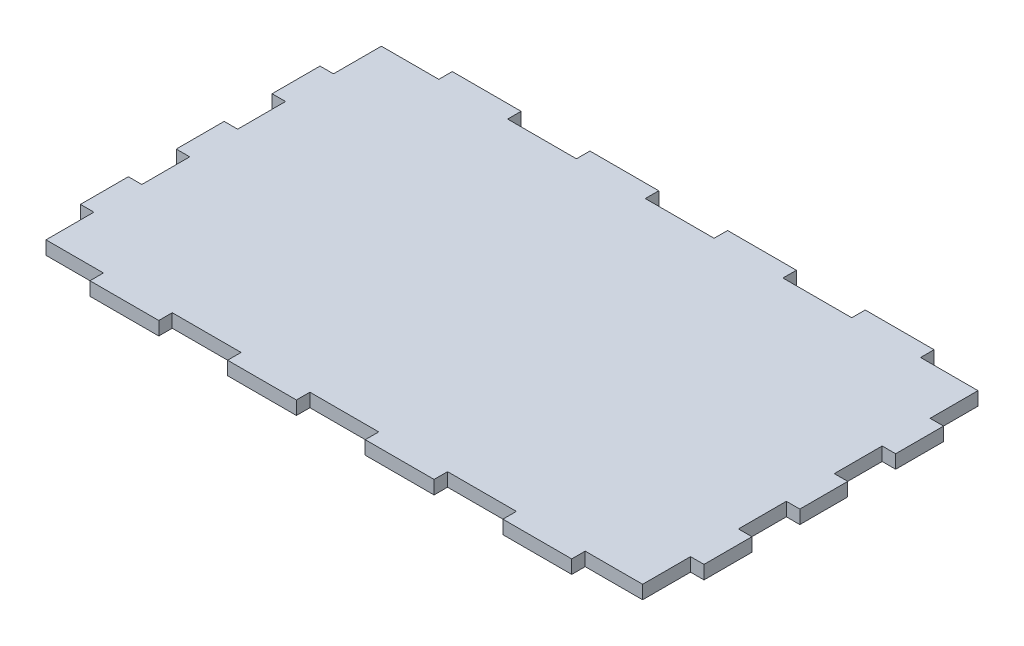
ISO-10303-21;
HEADER;
FILE_DESCRIPTION(('STEP AP214'),'2;1');
FILE_NAME('part.step','',(''),(''),'','','');
FILE_SCHEMA(('AUTOMOTIVE_DESIGN { 1 0 10303 214 1 1 1 1 }'));
ENDSEC;
DATA;
#1=APPLICATION_CONTEXT('core data for automotive mechanical design processes');
#2=APPLICATION_PROTOCOL_DEFINITION('international standard','automotive_design',2000,#1);
#3=PRODUCT_CONTEXT('',#1,'mechanical');
#4=PRODUCT('Part','Part','',(#3));
#5=PRODUCT_RELATED_PRODUCT_CATEGORY('part','',(#4));
#6=PRODUCT_DEFINITION_FORMATION('','',#4);
#7=PRODUCT_DEFINITION_CONTEXT('part definition',#1,'design');
#8=PRODUCT_DEFINITION('design','',#6,#7);
#9=PRODUCT_DEFINITION_SHAPE('','',#8);
#10=(LENGTH_UNIT() NAMED_UNIT(*) SI_UNIT(.MILLI.,.METRE.));
#11=(NAMED_UNIT(*) PLANE_ANGLE_UNIT() SI_UNIT($,.RADIAN.));
#12=(NAMED_UNIT(*) SI_UNIT($,.STERADIAN.) SOLID_ANGLE_UNIT());
#13=UNCERTAINTY_MEASURE_WITH_UNIT(LENGTH_MEASURE(1.E-05),#10,'distance_accuracy_value','');
#14=(GEOMETRIC_REPRESENTATION_CONTEXT(3) GLOBAL_UNCERTAINTY_ASSIGNED_CONTEXT((#13)) GLOBAL_UNIT_ASSIGNED_CONTEXT((#10,
#11,#12)) REPRESENTATION_CONTEXT('',''));
#15=CARTESIAN_POINT('',(0.,0.,0.));
#16=DIRECTION('',(0.,0.,1.));
#17=DIRECTION('',(1.,0.,0.));
#18=AXIS2_PLACEMENT_3D('',#15,#16,#17);
#19=CARTESIAN_POINT('',(366.412,9.,0.));
#20=DIRECTION('',(-1.,0.,0.));
#21=DIRECTION('',(0.,0.,1.));
#22=AXIS2_PLACEMENT_3D('',#19,#20,#21);
#23=PLANE('',#22);
#24=DIRECTION('',(0.,0.,-1.));
#25=VECTOR('',#24,1.);
#26=CARTESIAN_POINT('',(366.412,0.,0.));
#27=LINE('',#26,#25);
#28=CARTESIAN_POINT('',(366.412,0.,233.028));
#29=VERTEX_POINT('',#28);
#30=CARTESIAN_POINT('',(366.412,0.,224.028));
#31=VERTEX_POINT('',#30);
#32=EDGE_CURVE('E454',#29,#31,#27,.T.);
#33=ORIENTED_EDGE('',*,*,#32,.T.);
#34=DIRECTION('',(0.,-1.,0.));
#35=VECTOR('',#34,1.);
#36=CARTESIAN_POINT('',(366.412,9.,224.028));
#37=LINE('',#36,#35);
#38=CARTESIAN_POINT('',(366.412,9.,224.028));
#39=VERTEX_POINT('',#38);
#40=EDGE_CURVE('E11',#39,#31,#37,.T.);
#41=ORIENTED_EDGE('',*,*,#40,.F.);
#42=DIRECTION('',(0.,0.,-1.));
#43=VECTOR('',#42,1.);
#44=CARTESIAN_POINT('',(366.412,9.,0.));
#45=LINE('',#44,#43);
#46=CARTESIAN_POINT('',(366.412,9.,233.028));
#47=VERTEX_POINT('',#46);
#48=EDGE_CURVE('E674',#47,#39,#45,.T.);
#49=ORIENTED_EDGE('',*,*,#48,.F.);
#50=DIRECTION('',(0.,-1.,0.));
#51=VECTOR('',#50,1.);
#52=CARTESIAN_POINT('',(366.412,9.,233.028));
#53=LINE('',#52,#51);
#54=EDGE_CURVE('E450',#47,#29,#53,.T.);
#55=ORIENTED_EDGE('',*,*,#54,.T.);
#56=EDGE_LOOP('',(#33,#41,#49,#55));
#57=FACE_BOUND('',#56,.T.);
#58=ADVANCED_FACE('F41',(#57),#23,.F.);
#59=CARTESIAN_POINT('',(0.,9.,224.028));
#60=DIRECTION('',(0.,0.,-1.));
#61=DIRECTION('',(-1.,0.,0.));
#62=AXIS2_PLACEMENT_3D('',#59,#60,#61);
#63=PLANE('',#62);
#64=DIRECTION('',(1.,0.,0.));
#65=VECTOR('',#64,1.);
#66=CARTESIAN_POINT('',(0.,0.,224.028));
#67=LINE('',#66,#65);
#68=CARTESIAN_POINT('',(404.766,0.,224.028));
#69=VERTEX_POINT('',#68);
#70=EDGE_CURVE('E458',#31,#69,#67,.T.);
#71=ORIENTED_EDGE('',*,*,#70,.T.);
#72=DIRECTION('',(0.,-1.,0.));
#73=VECTOR('',#72,1.);
#74=CARTESIAN_POINT('',(404.766,9.,224.028));
#75=LINE('',#74,#73);
#76=CARTESIAN_POINT('',(404.766,9.,224.028));
#77=VERTEX_POINT('',#76);
#78=EDGE_CURVE('E50',#77,#69,#75,.T.);
#79=ORIENTED_EDGE('',*,*,#78,.F.);
#80=DIRECTION('',(1.,0.,0.));
#81=VECTOR('',#80,1.);
#82=CARTESIAN_POINT('',(0.,9.,224.028));
#83=LINE('',#82,#81);
#84=EDGE_CURVE('E257',#39,#77,#83,.T.);
#85=ORIENTED_EDGE('',*,*,#84,.F.);
#86=ORIENTED_EDGE('',*,*,#40,.T.);
#87=EDGE_LOOP('',(#71,#79,#85,#86));
#88=FACE_BOUND('',#87,.T.);
#89=ADVANCED_FACE('F862',(#88),#63,.F.);
#90=CARTESIAN_POINT('',(404.766,9.,0.));
#91=DIRECTION('',(1.,0.,0.));
#92=DIRECTION('',(0.,0.,-1.));
#93=AXIS2_PLACEMENT_3D('',#90,#91,#92);
#94=PLANE('',#93);
#95=DIRECTION('',(0.,0.,1.));
#96=VECTOR('',#95,1.);
#97=CARTESIAN_POINT('',(404.766,0.,0.));
#98=LINE('',#97,#96);
#99=CARTESIAN_POINT('',(404.766,0.,192.024));
#100=VERTEX_POINT('',#99);
#101=EDGE_CURVE('E462',#100,#69,#98,.T.);
#102=ORIENTED_EDGE('',*,*,#101,.F.);
#103=DIRECTION('',(0.,-1.,0.));
#104=VECTOR('',#103,1.);
#105=CARTESIAN_POINT('',(404.766,9.,192.024));
#106=LINE('',#105,#104);
#107=CARTESIAN_POINT('',(404.766,9.,192.024));
#108=VERTEX_POINT('',#107);
#109=EDGE_CURVE('E853',#108,#100,#106,.T.);
#110=ORIENTED_EDGE('',*,*,#109,.F.);
#111=DIRECTION('',(0.,0.,1.));
#112=VECTOR('',#111,1.);
#113=CARTESIAN_POINT('',(404.766,9.,0.));
#114=LINE('',#113,#112);
#115=EDGE_CURVE('E861',#108,#77,#114,.T.);
#116=ORIENTED_EDGE('',*,*,#115,.T.);
#117=ORIENTED_EDGE('',*,*,#78,.T.);
#118=EDGE_LOOP('',(#102,#110,#116,#117));
#119=FACE_BOUND('',#118,.T.);
#120=ADVANCED_FACE('F859',(#119),#94,.T.);
#121=CARTESIAN_POINT('',(5.92192961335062E-13,9.,192.024000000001));
#122=DIRECTION('',(0.,0.,-1.));
#123=DIRECTION('',(-1.,0.,0.));
#124=AXIS2_PLACEMENT_3D('',#121,#122,#123);
#125=PLANE('',#124);
#126=DIRECTION('',(1.,0.,0.));
#127=VECTOR('',#126,1.);
#128=CARTESIAN_POINT('',(5.92192961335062E-13,0.,192.024000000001));
#129=LINE('',#128,#127);
#130=CARTESIAN_POINT('',(413.766,0.,192.024));
#131=VERTEX_POINT('',#130);
#132=EDGE_CURVE('E466',#100,#131,#129,.T.);
#133=ORIENTED_EDGE('',*,*,#132,.T.);
#134=DIRECTION('',(0.,-1.,0.));
#135=VECTOR('',#134,1.);
#136=CARTESIAN_POINT('',(413.766,9.,192.024));
#137=LINE('',#136,#135);
#138=CARTESIAN_POINT('',(413.766,9.,192.024));
#139=VERTEX_POINT('',#138);
#140=EDGE_CURVE('E850',#139,#131,#137,.T.);
#141=ORIENTED_EDGE('',*,*,#140,.F.);
#142=DIRECTION('',(1.,0.,0.));
#143=VECTOR('',#142,1.);
#144=CARTESIAN_POINT('',(5.92192961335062E-13,9.,192.024000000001));
#145=LINE('',#144,#143);
#146=EDGE_CURVE('E875',#108,#139,#145,.T.);
#147=ORIENTED_EDGE('',*,*,#146,.F.);
#148=ORIENTED_EDGE('',*,*,#109,.T.);
#149=EDGE_LOOP('',(#133,#141,#147,#148));
#150=FACE_BOUND('',#149,.T.);
#151=ADVANCED_FACE('F872',(#150),#125,.F.);
#152=CARTESIAN_POINT('',(413.766,9.,-7.17679883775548E-13));
#153=DIRECTION('',(1.,0.,0.));
#154=DIRECTION('',(0.,0.,-1.));
#155=AXIS2_PLACEMENT_3D('',#152,#153,#154);
#156=PLANE('',#155);
#157=DIRECTION('',(0.,0.,1.));
#158=VECTOR('',#157,1.);
#159=CARTESIAN_POINT('',(413.766,0.,-7.17679883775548E-13));
#160=LINE('',#159,#158);
#161=CARTESIAN_POINT('',(413.766,0.,160.02));
#162=VERTEX_POINT('',#161);
#163=EDGE_CURVE('E470',#162,#131,#160,.T.);
#164=ORIENTED_EDGE('',*,*,#163,.F.);
#165=DIRECTION('',(0.,-1.,0.));
#166=VECTOR('',#165,1.);
#167=CARTESIAN_POINT('',(413.766,9.,160.02));
#168=LINE('',#167,#166);
#169=CARTESIAN_POINT('',(413.766,9.,160.02));
#170=VERTEX_POINT('',#169);
#171=EDGE_CURVE('E847',#170,#162,#168,.T.);
#172=ORIENTED_EDGE('',*,*,#171,.F.);
#173=DIRECTION('',(0.,0.,1.));
#174=VECTOR('',#173,1.);
#175=CARTESIAN_POINT('',(413.766,9.,-7.17679883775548E-13));
#176=LINE('',#175,#174);
#177=EDGE_CURVE('E878',#170,#139,#176,.T.);
#178=ORIENTED_EDGE('',*,*,#177,.T.);
#179=ORIENTED_EDGE('',*,*,#140,.T.);
#180=EDGE_LOOP('',(#164,#172,#178,#179));
#181=FACE_BOUND('',#180,.T.);
#182=ADVANCED_FACE('F1102',(#181),#156,.T.);
#183=CARTESIAN_POINT('',(0.,9.,160.02));
#184=DIRECTION('',(0.,0.,1.));
#185=DIRECTION('',(1.,0.,0.));
#186=AXIS2_PLACEMENT_3D('',#183,#184,#185);
#187=PLANE('',#186);
#188=DIRECTION('',(-1.,0.,0.));
#189=VECTOR('',#188,1.);
#190=CARTESIAN_POINT('',(0.,0.,160.02));
#191=LINE('',#190,#189);
#192=CARTESIAN_POINT('',(404.766,0.,160.02));
#193=VERTEX_POINT('',#192);
#194=EDGE_CURVE('E474',#162,#193,#191,.T.);
#195=ORIENTED_EDGE('',*,*,#194,.T.);
#196=DIRECTION('',(0.,-1.,0.));
#197=VECTOR('',#196,1.);
#198=CARTESIAN_POINT('',(404.766,9.,160.02));
#199=LINE('',#198,#197);
#200=CARTESIAN_POINT('',(404.766,9.,160.02));
#201=VERTEX_POINT('',#200);
#202=EDGE_CURVE('E844',#201,#193,#199,.T.);
#203=ORIENTED_EDGE('',*,*,#202,.F.);
#204=DIRECTION('',(-1.,0.,0.));
#205=VECTOR('',#204,1.);
#206=CARTESIAN_POINT('',(0.,9.,160.02));
#207=LINE('',#206,#205);
#208=EDGE_CURVE('E888',#170,#201,#207,.T.);
#209=ORIENTED_EDGE('',*,*,#208,.F.);
#210=ORIENTED_EDGE('',*,*,#171,.T.);
#211=EDGE_LOOP('',(#195,#203,#209,#210));
#212=FACE_BOUND('',#211,.T.);
#213=ADVANCED_FACE('F1105',(#212),#187,.F.);
#214=CARTESIAN_POINT('',(404.766,9.,0.));
#215=DIRECTION('',(1.,0.,0.));
#216=DIRECTION('',(0.,0.,-1.));
#217=AXIS2_PLACEMENT_3D('',#214,#215,#216);
#218=PLANE('',#217);
#219=DIRECTION('',(0.,0.,1.));
#220=VECTOR('',#219,1.);
#221=CARTESIAN_POINT('',(404.766,0.,0.));
#222=LINE('',#221,#220);
#223=CARTESIAN_POINT('',(404.766,0.,128.016));
#224=VERTEX_POINT('',#223);
#225=EDGE_CURVE('E478',#224,#193,#222,.T.);
#226=ORIENTED_EDGE('',*,*,#225,.F.);
#227=DIRECTION('',(0.,-1.,0.));
#228=VECTOR('',#227,1.);
#229=CARTESIAN_POINT('',(404.766,9.,128.016));
#230=LINE('',#229,#228);
#231=CARTESIAN_POINT('',(404.766,9.,128.016));
#232=VERTEX_POINT('',#231);
#233=EDGE_CURVE('E841',#232,#224,#230,.T.);
#234=ORIENTED_EDGE('',*,*,#233,.F.);
#235=DIRECTION('',(0.,0.,1.));
#236=VECTOR('',#235,1.);
#237=CARTESIAN_POINT('',(404.766,9.,0.));
#238=LINE('',#237,#236);
#239=EDGE_CURVE('E891',#232,#201,#238,.T.);
#240=ORIENTED_EDGE('',*,*,#239,.T.);
#241=ORIENTED_EDGE('',*,*,#202,.T.);
#242=EDGE_LOOP('',(#226,#234,#240,#241));
#243=FACE_BOUND('',#242,.T.);
#244=ADVANCED_FACE('F1109',(#243),#218,.T.);
#245=CARTESIAN_POINT('',(0.,9.,128.016));
#246=DIRECTION('',(0.,0.,-1.));
#247=DIRECTION('',(-1.,0.,0.));
#248=AXIS2_PLACEMENT_3D('',#245,#246,#247);
#249=PLANE('',#248);
#250=DIRECTION('',(1.,0.,0.));
#251=VECTOR('',#250,1.);
#252=CARTESIAN_POINT('',(0.,0.,128.016));
#253=LINE('',#252,#251);
#254=CARTESIAN_POINT('',(413.766,0.,128.016));
#255=VERTEX_POINT('',#254);
#256=EDGE_CURVE('E482',#224,#255,#253,.T.);
#257=ORIENTED_EDGE('',*,*,#256,.T.);
#258=DIRECTION('',(0.,-1.,0.));
#259=VECTOR('',#258,1.);
#260=CARTESIAN_POINT('',(413.766,9.,128.016));
#261=LINE('',#260,#259);
#262=CARTESIAN_POINT('',(413.766,9.,128.016));
#263=VERTEX_POINT('',#262);
#264=EDGE_CURVE('E838',#263,#255,#261,.T.);
#265=ORIENTED_EDGE('',*,*,#264,.F.);
#266=DIRECTION('',(1.,0.,0.));
#267=VECTOR('',#266,1.);
#268=CARTESIAN_POINT('',(0.,9.,128.016));
#269=LINE('',#268,#267);
#270=EDGE_CURVE('E895',#232,#263,#269,.T.);
#271=ORIENTED_EDGE('',*,*,#270,.F.);
#272=ORIENTED_EDGE('',*,*,#233,.T.);
#273=EDGE_LOOP('',(#257,#265,#271,#272));
#274=FACE_BOUND('',#273,.T.);
#275=ADVANCED_FACE('F1113',(#274),#249,.F.);
#276=CARTESIAN_POINT('',(413.766,9.,0.));
#277=DIRECTION('',(1.,0.,0.));
#278=DIRECTION('',(0.,0.,-1.));
#279=AXIS2_PLACEMENT_3D('',#276,#277,#278);
#280=PLANE('',#279);
#281=DIRECTION('',(0.,0.,1.));
#282=VECTOR('',#281,1.);
#283=CARTESIAN_POINT('',(413.766,0.,0.));
#284=LINE('',#283,#282);
#285=CARTESIAN_POINT('',(413.766,0.,96.012));
#286=VERTEX_POINT('',#285);
#287=EDGE_CURVE('E486',#286,#255,#284,.T.);
#288=ORIENTED_EDGE('',*,*,#287,.F.);
#289=DIRECTION('',(0.,-1.,0.));
#290=VECTOR('',#289,1.);
#291=CARTESIAN_POINT('',(413.766,9.,96.012));
#292=LINE('',#291,#290);
#293=CARTESIAN_POINT('',(413.766,9.,96.012));
#294=VERTEX_POINT('',#293);
#295=EDGE_CURVE('E835',#294,#286,#292,.T.);
#296=ORIENTED_EDGE('',*,*,#295,.F.);
#297=DIRECTION('',(0.,0.,1.));
#298=VECTOR('',#297,1.);
#299=CARTESIAN_POINT('',(413.766,9.,0.));
#300=LINE('',#299,#298);
#301=EDGE_CURVE('E898',#294,#263,#300,.T.);
#302=ORIENTED_EDGE('',*,*,#301,.T.);
#303=ORIENTED_EDGE('',*,*,#264,.T.);
#304=EDGE_LOOP('',(#288,#296,#302,#303));
#305=FACE_BOUND('',#304,.T.);
#306=ADVANCED_FACE('F1117',(#305),#280,.T.);
#307=CARTESIAN_POINT('',(0.,9.,96.012));
#308=DIRECTION('',(0.,0.,1.));
#309=DIRECTION('',(1.,0.,0.));
#310=AXIS2_PLACEMENT_3D('',#307,#308,#309);
#311=PLANE('',#310);
#312=DIRECTION('',(-1.,0.,0.));
#313=VECTOR('',#312,1.);
#314=CARTESIAN_POINT('',(0.,0.,96.012));
#315=LINE('',#314,#313);
#316=CARTESIAN_POINT('',(404.766,0.,96.012));
#317=VERTEX_POINT('',#316);
#318=EDGE_CURVE('E490',#286,#317,#315,.T.);
#319=ORIENTED_EDGE('',*,*,#318,.T.);
#320=DIRECTION('',(0.,-1.,0.));
#321=VECTOR('',#320,1.);
#322=CARTESIAN_POINT('',(404.766,9.,96.012));
#323=LINE('',#322,#321);
#324=CARTESIAN_POINT('',(404.766,9.,96.012));
#325=VERTEX_POINT('',#324);
#326=EDGE_CURVE('E832',#325,#317,#323,.T.);
#327=ORIENTED_EDGE('',*,*,#326,.F.);
#328=DIRECTION('',(-1.,0.,0.));
#329=VECTOR('',#328,1.);
#330=CARTESIAN_POINT('',(0.,9.,96.012));
#331=LINE('',#330,#329);
#332=EDGE_CURVE('E902',#294,#325,#331,.T.);
#333=ORIENTED_EDGE('',*,*,#332,.F.);
#334=ORIENTED_EDGE('',*,*,#295,.T.);
#335=EDGE_LOOP('',(#319,#327,#333,#334));
#336=FACE_BOUND('',#335,.T.);
#337=ADVANCED_FACE('F1121',(#336),#311,.F.);
#338=CARTESIAN_POINT('',(404.766,9.,0.));
#339=DIRECTION('',(1.,0.,0.));
#340=DIRECTION('',(0.,0.,-1.));
#341=AXIS2_PLACEMENT_3D('',#338,#339,#340);
#342=PLANE('',#341);
#343=DIRECTION('',(0.,0.,1.));
#344=VECTOR('',#343,1.);
#345=CARTESIAN_POINT('',(404.766,0.,0.));
#346=LINE('',#345,#344);
#347=CARTESIAN_POINT('',(404.766,0.,64.008));
#348=VERTEX_POINT('',#347);
#349=EDGE_CURVE('E494',#348,#317,#346,.T.);
#350=ORIENTED_EDGE('',*,*,#349,.F.);
#351=DIRECTION('',(0.,-1.,0.));
#352=VECTOR('',#351,1.);
#353=CARTESIAN_POINT('',(404.766,9.,64.008));
#354=LINE('',#353,#352);
#355=CARTESIAN_POINT('',(404.766,9.,64.008));
#356=VERTEX_POINT('',#355);
#357=EDGE_CURVE('E829',#356,#348,#354,.T.);
#358=ORIENTED_EDGE('',*,*,#357,.F.);
#359=DIRECTION('',(0.,0.,1.));
#360=VECTOR('',#359,1.);
#361=CARTESIAN_POINT('',(404.766,9.,0.));
#362=LINE('',#361,#360);
#363=EDGE_CURVE('E905',#356,#325,#362,.T.);
#364=ORIENTED_EDGE('',*,*,#363,.T.);
#365=ORIENTED_EDGE('',*,*,#326,.T.);
#366=EDGE_LOOP('',(#350,#358,#364,#365));
#367=FACE_BOUND('',#366,.T.);
#368=ADVANCED_FACE('F1125',(#367),#342,.T.);
#369=CARTESIAN_POINT('',(0.,9.,64.008));
#370=DIRECTION('',(0.,0.,-1.));
#371=DIRECTION('',(-1.,0.,0.));
#372=AXIS2_PLACEMENT_3D('',#369,#370,#371);
#373=PLANE('',#372);
#374=DIRECTION('',(1.,0.,0.));
#375=VECTOR('',#374,1.);
#376=CARTESIAN_POINT('',(0.,0.,64.008));
#377=LINE('',#376,#375);
#378=CARTESIAN_POINT('',(413.766,0.,64.008));
#379=VERTEX_POINT('',#378);
#380=EDGE_CURVE('E498',#348,#379,#377,.T.);
#381=ORIENTED_EDGE('',*,*,#380,.T.);
#382=DIRECTION('',(0.,-1.,0.));
#383=VECTOR('',#382,1.);
#384=CARTESIAN_POINT('',(413.766,9.,64.008));
#385=LINE('',#384,#383);
#386=CARTESIAN_POINT('',(413.766,9.,64.008));
#387=VERTEX_POINT('',#386);
#388=EDGE_CURVE('E826',#387,#379,#385,.T.);
#389=ORIENTED_EDGE('',*,*,#388,.F.);
#390=DIRECTION('',(1.,0.,0.));
#391=VECTOR('',#390,1.);
#392=CARTESIAN_POINT('',(0.,9.,64.008));
#393=LINE('',#392,#391);
#394=EDGE_CURVE('E909',#356,#387,#393,.T.);
#395=ORIENTED_EDGE('',*,*,#394,.F.);
#396=ORIENTED_EDGE('',*,*,#357,.T.);
#397=EDGE_LOOP('',(#381,#389,#395,#396));
#398=FACE_BOUND('',#397,.T.);
#399=ADVANCED_FACE('F1129',(#398),#373,.F.);
#400=CARTESIAN_POINT('',(413.766,9.,0.));
#401=DIRECTION('',(1.,0.,0.));
#402=DIRECTION('',(0.,0.,-1.));
#403=AXIS2_PLACEMENT_3D('',#400,#401,#402);
#404=PLANE('',#403);
#405=DIRECTION('',(0.,0.,1.));
#406=VECTOR('',#405,1.);
#407=CARTESIAN_POINT('',(413.766,0.,0.));
#408=LINE('',#407,#406);
#409=CARTESIAN_POINT('',(413.766,0.,32.004));
#410=VERTEX_POINT('',#409);
#411=EDGE_CURVE('E502',#410,#379,#408,.T.);
#412=ORIENTED_EDGE('',*,*,#411,.F.);
#413=DIRECTION('',(0.,-1.,0.));
#414=VECTOR('',#413,1.);
#415=CARTESIAN_POINT('',(413.766,9.,32.004));
#416=LINE('',#415,#414);
#417=CARTESIAN_POINT('',(413.766,9.,32.004));
#418=VERTEX_POINT('',#417);
#419=EDGE_CURVE('E823',#418,#410,#416,.T.);
#420=ORIENTED_EDGE('',*,*,#419,.F.);
#421=DIRECTION('',(0.,0.,1.));
#422=VECTOR('',#421,1.);
#423=CARTESIAN_POINT('',(413.766,9.,0.));
#424=LINE('',#423,#422);
#425=EDGE_CURVE('E912',#418,#387,#424,.T.);
#426=ORIENTED_EDGE('',*,*,#425,.T.);
#427=ORIENTED_EDGE('',*,*,#388,.T.);
#428=EDGE_LOOP('',(#412,#420,#426,#427));
#429=FACE_BOUND('',#428,.T.);
#430=ADVANCED_FACE('F1133',(#429),#404,.T.);
#431=CARTESIAN_POINT('',(0.,9.,32.004));
#432=DIRECTION('',(0.,0.,1.));
#433=DIRECTION('',(1.,0.,0.));
#434=AXIS2_PLACEMENT_3D('',#431,#432,#433);
#435=PLANE('',#434);
#436=DIRECTION('',(-1.,0.,0.));
#437=VECTOR('',#436,1.);
#438=CARTESIAN_POINT('',(0.,0.,32.004));
#439=LINE('',#438,#437);
#440=CARTESIAN_POINT('',(404.766,0.,32.004));
#441=VERTEX_POINT('',#440);
#442=EDGE_CURVE('E506',#410,#441,#439,.T.);
#443=ORIENTED_EDGE('',*,*,#442,.T.);
#444=DIRECTION('',(0.,-1.,0.));
#445=VECTOR('',#444,1.);
#446=CARTESIAN_POINT('',(404.766,9.,32.004));
#447=LINE('',#446,#445);
#448=CARTESIAN_POINT('',(404.766,9.,32.004));
#449=VERTEX_POINT('',#448);
#450=EDGE_CURVE('E819',#449,#441,#447,.T.);
#451=ORIENTED_EDGE('',*,*,#450,.F.);
#452=DIRECTION('',(-1.,0.,0.));
#453=VECTOR('',#452,1.);
#454=CARTESIAN_POINT('',(0.,9.,32.004));
#455=LINE('',#454,#453);
#456=EDGE_CURVE('E916',#418,#449,#455,.T.);
#457=ORIENTED_EDGE('',*,*,#456,.F.);
#458=ORIENTED_EDGE('',*,*,#419,.T.);
#459=EDGE_LOOP('',(#443,#451,#457,#458));
#460=FACE_BOUND('',#459,.T.);
#461=ADVANCED_FACE('F1137',(#460),#435,.F.);
#462=CARTESIAN_POINT('',(404.766,9.,0.));
#463=DIRECTION('',(-1.,0.,0.));
#464=DIRECTION('',(0.,0.,1.));
#465=AXIS2_PLACEMENT_3D('',#462,#463,#464);
#466=PLANE('',#465);
#467=DIRECTION('',(0.,0.,-1.));
#468=VECTOR('',#467,1.);
#469=CARTESIAN_POINT('',(404.766,0.,0.));
#470=LINE('',#469,#468);
#471=CARTESIAN_POINT('',(404.766,0.,0.));
#472=VERTEX_POINT('',#471);
#473=EDGE_CURVE('E509',#441,#472,#470,.T.);
#474=ORIENTED_EDGE('',*,*,#473,.T.);
#475=DIRECTION('',(0.,-1.,0.));
#476=VECTOR('',#475,1.);
#477=CARTESIAN_POINT('',(404.766,9.,0.));
#478=LINE('',#477,#476);
#479=CARTESIAN_POINT('',(404.766,9.,0.));
#480=VERTEX_POINT('',#479);
#481=EDGE_CURVE('E816',#480,#472,#478,.T.);
#482=ORIENTED_EDGE('',*,*,#481,.F.);
#483=DIRECTION('',(0.,0.,-1.));
#484=VECTOR('',#483,1.);
#485=CARTESIAN_POINT('',(404.766,9.,0.));
#486=LINE('',#485,#484);
#487=EDGE_CURVE('E919',#449,#480,#486,.T.);
#488=ORIENTED_EDGE('',*,*,#487,.F.);
#489=ORIENTED_EDGE('',*,*,#450,.T.);
#490=EDGE_LOOP('',(#474,#482,#488,#489));
#491=FACE_BOUND('',#490,.T.);
#492=ADVANCED_FACE('F1141',(#491),#466,.F.);
#493=CARTESIAN_POINT('',(0.,9.,0.));
#494=DIRECTION('',(0.,0.,-1.));
#495=DIRECTION('',(-1.,0.,0.));
#496=AXIS2_PLACEMENT_3D('',#493,#494,#495);
#497=PLANE('',#496);
#498=DIRECTION('',(1.,0.,0.));
#499=VECTOR('',#498,1.);
#500=CARTESIAN_POINT('',(0.,0.,0.));
#501=LINE('',#500,#499);
#502=CARTESIAN_POINT('',(366.412,0.,0.));
#503=VERTEX_POINT('',#502);
#504=EDGE_CURVE('E513',#503,#472,#501,.T.);
#505=ORIENTED_EDGE('',*,*,#504,.F.);
#506=DIRECTION('',(0.,-1.,0.));
#507=VECTOR('',#506,1.);
#508=CARTESIAN_POINT('',(366.412,9.,0.));
#509=LINE('',#508,#507);
#510=CARTESIAN_POINT('',(366.412,9.,0.));
#511=VERTEX_POINT('',#510);
#512=EDGE_CURVE('E813',#511,#503,#509,.T.);
#513=ORIENTED_EDGE('',*,*,#512,.F.);
#514=DIRECTION('',(1.,0.,0.));
#515=VECTOR('',#514,1.);
#516=CARTESIAN_POINT('',(0.,9.,0.));
#517=LINE('',#516,#515);
#518=EDGE_CURVE('E922',#511,#480,#517,.T.);
#519=ORIENTED_EDGE('',*,*,#518,.T.);
#520=ORIENTED_EDGE('',*,*,#481,.T.);
#521=EDGE_LOOP('',(#505,#513,#519,#520));
#522=FACE_BOUND('',#521,.T.);
#523=ADVANCED_FACE('F1145',(#522),#497,.T.);
#524=CARTESIAN_POINT('',(366.412,9.,0.));
#525=DIRECTION('',(1.,0.,0.));
#526=DIRECTION('',(0.,0.,-1.));
#527=AXIS2_PLACEMENT_3D('',#524,#525,#526);
#528=PLANE('',#527);
#529=DIRECTION('',(0.,0.,1.));
#530=VECTOR('',#529,1.);
#531=CARTESIAN_POINT('',(366.412,0.,0.));
#532=LINE('',#531,#530);
#533=CARTESIAN_POINT('',(366.412,0.,-9.));
#534=VERTEX_POINT('',#533);
#535=EDGE_CURVE('E517',#534,#503,#532,.T.);
#536=ORIENTED_EDGE('',*,*,#535,.F.);
#537=DIRECTION('',(0.,-1.,0.));
#538=VECTOR('',#537,1.);
#539=CARTESIAN_POINT('',(366.412,9.,-9.));
#540=LINE('',#539,#538);
#541=CARTESIAN_POINT('',(366.412,9.,-9.));
#542=VERTEX_POINT('',#541);
#543=EDGE_CURVE('E810',#542,#534,#540,.T.);
#544=ORIENTED_EDGE('',*,*,#543,.F.);
#545=DIRECTION('',(0.,0.,1.));
#546=VECTOR('',#545,1.);
#547=CARTESIAN_POINT('',(366.412,9.,0.));
#548=LINE('',#547,#546);
#549=EDGE_CURVE('E926',#542,#511,#548,.T.);
#550=ORIENTED_EDGE('',*,*,#549,.T.);
#551=ORIENTED_EDGE('',*,*,#512,.T.);
#552=EDGE_LOOP('',(#536,#544,#550,#551));
#553=FACE_BOUND('',#552,.T.);
#554=ADVANCED_FACE('F1149',(#553),#528,.T.);
#555=CARTESIAN_POINT('',(0.,9.,-9.));
#556=DIRECTION('',(0.,0.,-1.));
#557=DIRECTION('',(-1.,0.,0.));
#558=AXIS2_PLACEMENT_3D('',#555,#556,#557);
#559=PLANE('',#558);
#560=DIRECTION('',(1.,0.,0.));
#561=VECTOR('',#560,1.);
#562=CARTESIAN_POINT('',(0.,0.,-9.));
#563=LINE('',#562,#561);
#564=CARTESIAN_POINT('',(320.438,0.,-9.));
#565=VERTEX_POINT('',#564);
#566=EDGE_CURVE('E521',#565,#534,#563,.T.);
#567=ORIENTED_EDGE('',*,*,#566,.F.);
#568=DIRECTION('',(0.,-1.,0.));
#569=VECTOR('',#568,1.);
#570=CARTESIAN_POINT('',(320.438,9.,-9.));
#571=LINE('',#570,#569);
#572=CARTESIAN_POINT('',(320.438,9.,-9.));
#573=VERTEX_POINT('',#572);
#574=EDGE_CURVE('E807',#573,#565,#571,.T.);
#575=ORIENTED_EDGE('',*,*,#574,.F.);
#576=DIRECTION('',(1.,0.,0.));
#577=VECTOR('',#576,1.);
#578=CARTESIAN_POINT('',(0.,9.,-9.));
#579=LINE('',#578,#577);
#580=EDGE_CURVE('E930',#573,#542,#579,.T.);
#581=ORIENTED_EDGE('',*,*,#580,.T.);
#582=ORIENTED_EDGE('',*,*,#543,.T.);
#583=EDGE_LOOP('',(#567,#575,#581,#582));
#584=FACE_BOUND('',#583,.T.);
#585=ADVANCED_FACE('F1153',(#584),#559,.T.);
#586=CARTESIAN_POINT('',(320.438,9.,0.));
#587=DIRECTION('',(-1.,0.,0.));
#588=DIRECTION('',(0.,0.,1.));
#589=AXIS2_PLACEMENT_3D('',#586,#587,#588);
#590=PLANE('',#589);
#591=DIRECTION('',(0.,0.,-1.));
#592=VECTOR('',#591,1.);
#593=CARTESIAN_POINT('',(320.438,0.,0.));
#594=LINE('',#593,#592);
#595=CARTESIAN_POINT('',(320.438,0.,0.));
#596=VERTEX_POINT('',#595);
#597=EDGE_CURVE('E525',#596,#565,#594,.T.);
#598=ORIENTED_EDGE('',*,*,#597,.F.);
#599=DIRECTION('',(0.,-1.,0.));
#600=VECTOR('',#599,1.);
#601=CARTESIAN_POINT('',(320.438,9.,0.));
#602=LINE('',#601,#600);
#603=CARTESIAN_POINT('',(320.438,9.,0.));
#604=VERTEX_POINT('',#603);
#605=EDGE_CURVE('E804',#604,#596,#602,.T.);
#606=ORIENTED_EDGE('',*,*,#605,.F.);
#607=DIRECTION('',(0.,0.,-1.));
#608=VECTOR('',#607,1.);
#609=CARTESIAN_POINT('',(320.438,9.,0.));
#610=LINE('',#609,#608);
#611=EDGE_CURVE('E934',#604,#573,#610,.T.);
#612=ORIENTED_EDGE('',*,*,#611,.T.);
#613=ORIENTED_EDGE('',*,*,#574,.T.);
#614=EDGE_LOOP('',(#598,#606,#612,#613));
#615=FACE_BOUND('',#614,.T.);
#616=ADVANCED_FACE('F1157',(#615),#590,.T.);
#617=CARTESIAN_POINT('',(0.,9.,0.));
#618=DIRECTION('',(0.,0.,-1.));
#619=DIRECTION('',(-1.,0.,0.));
#620=AXIS2_PLACEMENT_3D('',#617,#618,#619);
#621=PLANE('',#620);
#622=DIRECTION('',(1.,0.,0.));
#623=VECTOR('',#622,1.);
#624=CARTESIAN_POINT('',(0.,0.,0.));
#625=LINE('',#624,#623);
#626=CARTESIAN_POINT('',(274.464,0.,0.));
#627=VERTEX_POINT('',#626);
#628=EDGE_CURVE('E529',#627,#596,#625,.T.);
#629=ORIENTED_EDGE('',*,*,#628,.F.);
#630=DIRECTION('',(0.,-1.,0.));
#631=VECTOR('',#630,1.);
#632=CARTESIAN_POINT('',(274.464,9.,0.));
#633=LINE('',#632,#631);
#634=CARTESIAN_POINT('',(274.464,9.,0.));
#635=VERTEX_POINT('',#634);
#636=EDGE_CURVE('E801',#635,#627,#633,.T.);
#637=ORIENTED_EDGE('',*,*,#636,.F.);
#638=DIRECTION('',(1.,0.,0.));
#639=VECTOR('',#638,1.);
#640=CARTESIAN_POINT('',(0.,9.,0.));
#641=LINE('',#640,#639);
#642=EDGE_CURVE('E938',#635,#604,#641,.T.);
#643=ORIENTED_EDGE('',*,*,#642,.T.);
#644=ORIENTED_EDGE('',*,*,#605,.T.);
#645=EDGE_LOOP('',(#629,#637,#643,#644));
#646=FACE_BOUND('',#645,.T.);
#647=ADVANCED_FACE('F1161',(#646),#621,.T.);
#648=CARTESIAN_POINT('',(274.464,9.,0.));
#649=DIRECTION('',(1.,0.,0.));
#650=DIRECTION('',(0.,0.,-1.));
#651=AXIS2_PLACEMENT_3D('',#648,#649,#650);
#652=PLANE('',#651);
#653=DIRECTION('',(0.,0.,1.));
#654=VECTOR('',#653,1.);
#655=CARTESIAN_POINT('',(274.464,0.,0.));
#656=LINE('',#655,#654);
#657=CARTESIAN_POINT('',(274.464,0.,-9.));
#658=VERTEX_POINT('',#657);
#659=EDGE_CURVE('E533',#658,#627,#656,.T.);
#660=ORIENTED_EDGE('',*,*,#659,.F.);
#661=DIRECTION('',(0.,-1.,0.));
#662=VECTOR('',#661,1.);
#663=CARTESIAN_POINT('',(274.464,9.,-9.));
#664=LINE('',#663,#662);
#665=CARTESIAN_POINT('',(274.464,9.,-9.));
#666=VERTEX_POINT('',#665);
#667=EDGE_CURVE('E798',#666,#658,#664,.T.);
#668=ORIENTED_EDGE('',*,*,#667,.F.);
#669=DIRECTION('',(0.,0.,1.));
#670=VECTOR('',#669,1.);
#671=CARTESIAN_POINT('',(274.464,9.,0.));
#672=LINE('',#671,#670);
#673=EDGE_CURVE('E942',#666,#635,#672,.T.);
#674=ORIENTED_EDGE('',*,*,#673,.T.);
#675=ORIENTED_EDGE('',*,*,#636,.T.);
#676=EDGE_LOOP('',(#660,#668,#674,#675));
#677=FACE_BOUND('',#676,.T.);
#678=ADVANCED_FACE('F1165',(#677),#652,.T.);
#679=CARTESIAN_POINT('',(0.,9.,-9.));
#680=DIRECTION('',(0.,0.,-1.));
#681=DIRECTION('',(-1.,0.,0.));
#682=AXIS2_PLACEMENT_3D('',#679,#680,#681);
#683=PLANE('',#682);
#684=DIRECTION('',(1.,0.,0.));
#685=VECTOR('',#684,1.);
#686=CARTESIAN_POINT('',(0.,0.,-9.));
#687=LINE('',#686,#685);
#688=CARTESIAN_POINT('',(228.49,0.,-9.));
#689=VERTEX_POINT('',#688);
#690=EDGE_CURVE('E537',#689,#658,#687,.T.);
#691=ORIENTED_EDGE('',*,*,#690,.F.);
#692=DIRECTION('',(0.,-1.,0.));
#693=VECTOR('',#692,1.);
#694=CARTESIAN_POINT('',(228.49,9.,-9.));
#695=LINE('',#694,#693);
#696=CARTESIAN_POINT('',(228.49,9.,-9.));
#697=VERTEX_POINT('',#696);
#698=EDGE_CURVE('E795',#697,#689,#695,.T.);
#699=ORIENTED_EDGE('',*,*,#698,.F.);
#700=DIRECTION('',(1.,0.,0.));
#701=VECTOR('',#700,1.);
#702=CARTESIAN_POINT('',(0.,9.,-9.));
#703=LINE('',#702,#701);
#704=EDGE_CURVE('E946',#697,#666,#703,.T.);
#705=ORIENTED_EDGE('',*,*,#704,.T.);
#706=ORIENTED_EDGE('',*,*,#667,.T.);
#707=EDGE_LOOP('',(#691,#699,#705,#706));
#708=FACE_BOUND('',#707,.T.);
#709=ADVANCED_FACE('F1169',(#708),#683,.T.);
#710=CARTESIAN_POINT('',(228.49,9.,0.));
#711=DIRECTION('',(-1.,0.,0.));
#712=DIRECTION('',(0.,0.,1.));
#713=AXIS2_PLACEMENT_3D('',#710,#711,#712);
#714=PLANE('',#713);
#715=DIRECTION('',(0.,0.,-1.));
#716=VECTOR('',#715,1.);
#717=CARTESIAN_POINT('',(228.49,0.,0.));
#718=LINE('',#717,#716);
#719=CARTESIAN_POINT('',(228.49,0.,0.));
#720=VERTEX_POINT('',#719);
#721=EDGE_CURVE('E541',#720,#689,#718,.T.);
#722=ORIENTED_EDGE('',*,*,#721,.F.);
#723=DIRECTION('',(0.,-1.,0.));
#724=VECTOR('',#723,1.);
#725=CARTESIAN_POINT('',(228.49,9.,0.));
#726=LINE('',#725,#724);
#727=CARTESIAN_POINT('',(228.49,9.,0.));
#728=VERTEX_POINT('',#727);
#729=EDGE_CURVE('E792',#728,#720,#726,.T.);
#730=ORIENTED_EDGE('',*,*,#729,.F.);
#731=DIRECTION('',(0.,0.,-1.));
#732=VECTOR('',#731,1.);
#733=CARTESIAN_POINT('',(228.49,9.,0.));
#734=LINE('',#733,#732);
#735=EDGE_CURVE('E950',#728,#697,#734,.T.);
#736=ORIENTED_EDGE('',*,*,#735,.T.);
#737=ORIENTED_EDGE('',*,*,#698,.T.);
#738=EDGE_LOOP('',(#722,#730,#736,#737));
#739=FACE_BOUND('',#738,.T.);
#740=ADVANCED_FACE('F1173',(#739),#714,.T.);
#741=CARTESIAN_POINT('',(0.,9.,0.));
#742=DIRECTION('',(0.,0.,-1.));
#743=DIRECTION('',(-1.,0.,0.));
#744=AXIS2_PLACEMENT_3D('',#741,#742,#743);
#745=PLANE('',#744);
#746=DIRECTION('',(1.,0.,0.));
#747=VECTOR('',#746,1.);
#748=CARTESIAN_POINT('',(0.,0.,0.));
#749=LINE('',#748,#747);
#750=CARTESIAN_POINT('',(182.516,0.,0.));
#751=VERTEX_POINT('',#750);
#752=EDGE_CURVE('E545',#751,#720,#749,.T.);
#753=ORIENTED_EDGE('',*,*,#752,.F.);
#754=DIRECTION('',(0.,-1.,0.));
#755=VECTOR('',#754,1.);
#756=CARTESIAN_POINT('',(182.516,9.,0.));
#757=LINE('',#756,#755);
#758=CARTESIAN_POINT('',(182.516,9.,0.));
#759=VERTEX_POINT('',#758);
#760=EDGE_CURVE('E789',#759,#751,#757,.T.);
#761=ORIENTED_EDGE('',*,*,#760,.F.);
#762=DIRECTION('',(1.,0.,0.));
#763=VECTOR('',#762,1.);
#764=CARTESIAN_POINT('',(0.,9.,0.));
#765=LINE('',#764,#763);
#766=EDGE_CURVE('E954',#759,#728,#765,.T.);
#767=ORIENTED_EDGE('',*,*,#766,.T.);
#768=ORIENTED_EDGE('',*,*,#729,.T.);
#769=EDGE_LOOP('',(#753,#761,#767,#768));
#770=FACE_BOUND('',#769,.T.);
#771=ADVANCED_FACE('F1177',(#770),#745,.T.);
#772=CARTESIAN_POINT('',(182.516,9.,0.));
#773=DIRECTION('',(1.,0.,0.));
#774=DIRECTION('',(0.,0.,-1.));
#775=AXIS2_PLACEMENT_3D('',#772,#773,#774);
#776=PLANE('',#775);
#777=DIRECTION('',(0.,0.,1.));
#778=VECTOR('',#777,1.);
#779=CARTESIAN_POINT('',(182.516,0.,0.));
#780=LINE('',#779,#778);
#781=CARTESIAN_POINT('',(182.516,0.,-9.));
#782=VERTEX_POINT('',#781);
#783=EDGE_CURVE('E549',#782,#751,#780,.T.);
#784=ORIENTED_EDGE('',*,*,#783,.F.);
#785=DIRECTION('',(0.,-1.,0.));
#786=VECTOR('',#785,1.);
#787=CARTESIAN_POINT('',(182.516,9.,-9.));
#788=LINE('',#787,#786);
#789=CARTESIAN_POINT('',(182.516,9.,-9.));
#790=VERTEX_POINT('',#789);
#791=EDGE_CURVE('E786',#790,#782,#788,.T.);
#792=ORIENTED_EDGE('',*,*,#791,.F.);
#793=DIRECTION('',(0.,0.,1.));
#794=VECTOR('',#793,1.);
#795=CARTESIAN_POINT('',(182.516,9.,0.));
#796=LINE('',#795,#794);
#797=EDGE_CURVE('E958',#790,#759,#796,.T.);
#798=ORIENTED_EDGE('',*,*,#797,.T.);
#799=ORIENTED_EDGE('',*,*,#760,.T.);
#800=EDGE_LOOP('',(#784,#792,#798,#799));
#801=FACE_BOUND('',#800,.T.);
#802=ADVANCED_FACE('F1181',(#801),#776,.T.);
#803=CARTESIAN_POINT('',(0.,9.,-9.));
#804=DIRECTION('',(0.,0.,-1.));
#805=DIRECTION('',(-1.,0.,0.));
#806=AXIS2_PLACEMENT_3D('',#803,#804,#805);
#807=PLANE('',#806);
#808=DIRECTION('',(1.,0.,0.));
#809=VECTOR('',#808,1.);
#810=CARTESIAN_POINT('',(0.,0.,-9.));
#811=LINE('',#810,#809);
#812=CARTESIAN_POINT('',(136.542,0.,-9.));
#813=VERTEX_POINT('',#812);
#814=EDGE_CURVE('E553',#813,#782,#811,.T.);
#815=ORIENTED_EDGE('',*,*,#814,.F.);
#816=DIRECTION('',(0.,-1.,0.));
#817=VECTOR('',#816,1.);
#818=CARTESIAN_POINT('',(136.542,9.,-9.));
#819=LINE('',#818,#817);
#820=CARTESIAN_POINT('',(136.542,9.,-9.));
#821=VERTEX_POINT('',#820);
#822=EDGE_CURVE('E783',#821,#813,#819,.T.);
#823=ORIENTED_EDGE('',*,*,#822,.F.);
#824=DIRECTION('',(1.,0.,0.));
#825=VECTOR('',#824,1.);
#826=CARTESIAN_POINT('',(0.,9.,-9.));
#827=LINE('',#826,#825);
#828=EDGE_CURVE('E962',#821,#790,#827,.T.);
#829=ORIENTED_EDGE('',*,*,#828,.T.);
#830=ORIENTED_EDGE('',*,*,#791,.T.);
#831=EDGE_LOOP('',(#815,#823,#829,#830));
#832=FACE_BOUND('',#831,.T.);
#833=ADVANCED_FACE('F1185',(#832),#807,.T.);
#834=CARTESIAN_POINT('',(136.542,9.,0.));
#835=DIRECTION('',(-1.,0.,0.));
#836=DIRECTION('',(0.,0.,1.));
#837=AXIS2_PLACEMENT_3D('',#834,#835,#836);
#838=PLANE('',#837);
#839=DIRECTION('',(0.,0.,-1.));
#840=VECTOR('',#839,1.);
#841=CARTESIAN_POINT('',(136.542,0.,0.));
#842=LINE('',#841,#840);
#843=CARTESIAN_POINT('',(136.542,0.,0.));
#844=VERTEX_POINT('',#843);
#845=EDGE_CURVE('E557',#844,#813,#842,.T.);
#846=ORIENTED_EDGE('',*,*,#845,.F.);
#847=DIRECTION('',(0.,-1.,0.));
#848=VECTOR('',#847,1.);
#849=CARTESIAN_POINT('',(136.542,9.,0.));
#850=LINE('',#849,#848);
#851=CARTESIAN_POINT('',(136.542,9.,0.));
#852=VERTEX_POINT('',#851);
#853=EDGE_CURVE('E780',#852,#844,#850,.T.);
#854=ORIENTED_EDGE('',*,*,#853,.F.);
#855=DIRECTION('',(0.,0.,-1.));
#856=VECTOR('',#855,1.);
#857=CARTESIAN_POINT('',(136.542,9.,0.));
#858=LINE('',#857,#856);
#859=EDGE_CURVE('E966',#852,#821,#858,.T.);
#860=ORIENTED_EDGE('',*,*,#859,.T.);
#861=ORIENTED_EDGE('',*,*,#822,.T.);
#862=EDGE_LOOP('',(#846,#854,#860,#861));
#863=FACE_BOUND('',#862,.T.);
#864=ADVANCED_FACE('F1189',(#863),#838,.T.);
#865=CARTESIAN_POINT('',(0.,9.,0.));
#866=DIRECTION('',(0.,0.,-1.));
#867=DIRECTION('',(-1.,0.,0.));
#868=AXIS2_PLACEMENT_3D('',#865,#866,#867);
#869=PLANE('',#868);
#870=DIRECTION('',(1.,0.,0.));
#871=VECTOR('',#870,1.);
#872=CARTESIAN_POINT('',(0.,0.,0.));
#873=LINE('',#872,#871);
#874=CARTESIAN_POINT('',(90.568,0.,0.));
#875=VERTEX_POINT('',#874);
#876=EDGE_CURVE('E561',#875,#844,#873,.T.);
#877=ORIENTED_EDGE('',*,*,#876,.F.);
#878=DIRECTION('',(0.,-1.,0.));
#879=VECTOR('',#878,1.);
#880=CARTESIAN_POINT('',(90.568,9.,0.));
#881=LINE('',#880,#879);
#882=CARTESIAN_POINT('',(90.568,9.,0.));
#883=VERTEX_POINT('',#882);
#884=EDGE_CURVE('E777',#883,#875,#881,.T.);
#885=ORIENTED_EDGE('',*,*,#884,.F.);
#886=DIRECTION('',(1.,0.,0.));
#887=VECTOR('',#886,1.);
#888=CARTESIAN_POINT('',(0.,9.,0.));
#889=LINE('',#888,#887);
#890=EDGE_CURVE('E970',#883,#852,#889,.T.);
#891=ORIENTED_EDGE('',*,*,#890,.T.);
#892=ORIENTED_EDGE('',*,*,#853,.T.);
#893=EDGE_LOOP('',(#877,#885,#891,#892));
#894=FACE_BOUND('',#893,.T.);
#895=ADVANCED_FACE('F1193',(#894),#869,.T.);
#896=CARTESIAN_POINT('',(90.568,9.,0.));
#897=DIRECTION('',(1.,0.,0.));
#898=DIRECTION('',(0.,0.,-1.));
#899=AXIS2_PLACEMENT_3D('',#896,#897,#898);
#900=PLANE('',#899);
#901=DIRECTION('',(0.,0.,1.));
#902=VECTOR('',#901,1.);
#903=CARTESIAN_POINT('',(90.568,0.,0.));
#904=LINE('',#903,#902);
#905=CARTESIAN_POINT('',(90.568,0.,-9.));
#906=VERTEX_POINT('',#905);
#907=EDGE_CURVE('E565',#906,#875,#904,.T.);
#908=ORIENTED_EDGE('',*,*,#907,.F.);
#909=DIRECTION('',(0.,-1.,0.));
#910=VECTOR('',#909,1.);
#911=CARTESIAN_POINT('',(90.568,9.,-9.));
#912=LINE('',#911,#910);
#913=CARTESIAN_POINT('',(90.568,9.,-9.));
#914=VERTEX_POINT('',#913);
#915=EDGE_CURVE('E774',#914,#906,#912,.T.);
#916=ORIENTED_EDGE('',*,*,#915,.F.);
#917=DIRECTION('',(0.,0.,1.));
#918=VECTOR('',#917,1.);
#919=CARTESIAN_POINT('',(90.568,9.,0.));
#920=LINE('',#919,#918);
#921=EDGE_CURVE('E974',#914,#883,#920,.T.);
#922=ORIENTED_EDGE('',*,*,#921,.T.);
#923=ORIENTED_EDGE('',*,*,#884,.T.);
#924=EDGE_LOOP('',(#908,#916,#922,#923));
#925=FACE_BOUND('',#924,.T.);
#926=ADVANCED_FACE('F1197',(#925),#900,.T.);
#927=CARTESIAN_POINT('',(0.,9.,-9.));
#928=DIRECTION('',(0.,0.,-1.));
#929=DIRECTION('',(-1.,0.,0.));
#930=AXIS2_PLACEMENT_3D('',#927,#928,#929);
#931=PLANE('',#930);
#932=DIRECTION('',(1.,0.,0.));
#933=VECTOR('',#932,1.);
#934=CARTESIAN_POINT('',(0.,0.,-9.));
#935=LINE('',#934,#933);
#936=CARTESIAN_POINT('',(44.594,0.,-9.));
#937=VERTEX_POINT('',#936);
#938=EDGE_CURVE('E569',#937,#906,#935,.T.);
#939=ORIENTED_EDGE('',*,*,#938,.F.);
#940=DIRECTION('',(0.,-1.,0.));
#941=VECTOR('',#940,1.);
#942=CARTESIAN_POINT('',(44.594,9.,-9.));
#943=LINE('',#942,#941);
#944=CARTESIAN_POINT('',(44.594,9.,-9.));
#945=VERTEX_POINT('',#944);
#946=EDGE_CURVE('E771',#945,#937,#943,.T.);
#947=ORIENTED_EDGE('',*,*,#946,.F.);
#948=DIRECTION('',(1.,0.,0.));
#949=VECTOR('',#948,1.);
#950=CARTESIAN_POINT('',(0.,9.,-9.));
#951=LINE('',#950,#949);
#952=EDGE_CURVE('E978',#945,#914,#951,.T.);
#953=ORIENTED_EDGE('',*,*,#952,.T.);
#954=ORIENTED_EDGE('',*,*,#915,.T.);
#955=EDGE_LOOP('',(#939,#947,#953,#954));
#956=FACE_BOUND('',#955,.T.);
#957=ADVANCED_FACE('F1201',(#956),#931,.T.);
#958=CARTESIAN_POINT('',(44.594,9.,0.));
#959=DIRECTION('',(-1.,0.,0.));
#960=DIRECTION('',(0.,0.,1.));
#961=AXIS2_PLACEMENT_3D('',#958,#959,#960);
#962=PLANE('',#961);
#963=DIRECTION('',(0.,0.,-1.));
#964=VECTOR('',#963,1.);
#965=CARTESIAN_POINT('',(44.594,0.,0.));
#966=LINE('',#965,#964);
#967=CARTESIAN_POINT('',(44.594,0.,0.));
#968=VERTEX_POINT('',#967);
#969=EDGE_CURVE('E573',#968,#937,#966,.T.);
#970=ORIENTED_EDGE('',*,*,#969,.F.);
#971=DIRECTION('',(0.,-1.,0.));
#972=VECTOR('',#971,1.);
#973=CARTESIAN_POINT('',(44.594,9.,0.));
#974=LINE('',#973,#972);
#975=CARTESIAN_POINT('',(44.594,9.,0.));
#976=VERTEX_POINT('',#975);
#977=EDGE_CURVE('E768',#976,#968,#974,.T.);
#978=ORIENTED_EDGE('',*,*,#977,.F.);
#979=DIRECTION('',(0.,0.,-1.));
#980=VECTOR('',#979,1.);
#981=CARTESIAN_POINT('',(44.594,9.,0.));
#982=LINE('',#981,#980);
#983=EDGE_CURVE('E982',#976,#945,#982,.T.);
#984=ORIENTED_EDGE('',*,*,#983,.T.);
#985=ORIENTED_EDGE('',*,*,#946,.T.);
#986=EDGE_LOOP('',(#970,#978,#984,#985));
#987=FACE_BOUND('',#986,.T.);
#988=ADVANCED_FACE('F1205',(#987),#962,.T.);
#989=CARTESIAN_POINT('',(0.,9.,0.));
#990=DIRECTION('',(0.,0.,-1.));
#991=DIRECTION('',(-1.,0.,0.));
#992=AXIS2_PLACEMENT_3D('',#989,#990,#991);
#993=PLANE('',#992);
#994=DIRECTION('',(1.,0.,0.));
#995=VECTOR('',#994,1.);
#996=CARTESIAN_POINT('',(0.,0.,0.));
#997=LINE('',#996,#995);
#998=CARTESIAN_POINT('',(6.24,0.,0.));
#999=VERTEX_POINT('',#998);
#1000=EDGE_CURVE('E577',#999,#968,#997,.T.);
#1001=ORIENTED_EDGE('',*,*,#1000,.F.);
#1002=DIRECTION('',(0.,-1.,0.));
#1003=VECTOR('',#1002,1.);
#1004=CARTESIAN_POINT('',(6.24,9.,0.));
#1005=LINE('',#1004,#1003);
#1006=CARTESIAN_POINT('',(6.24,9.,0.));
#1007=VERTEX_POINT('',#1006);
#1008=EDGE_CURVE('E765',#1007,#999,#1005,.T.);
#1009=ORIENTED_EDGE('',*,*,#1008,.F.);
#1010=DIRECTION('',(1.,0.,0.));
#1011=VECTOR('',#1010,1.);
#1012=CARTESIAN_POINT('',(0.,9.,0.));
#1013=LINE('',#1012,#1011);
#1014=EDGE_CURVE('E986',#1007,#976,#1013,.T.);
#1015=ORIENTED_EDGE('',*,*,#1014,.T.);
#1016=ORIENTED_EDGE('',*,*,#977,.T.);
#1017=EDGE_LOOP('',(#1001,#1009,#1015,#1016));
#1018=FACE_BOUND('',#1017,.T.);
#1019=ADVANCED_FACE('F1209',(#1018),#993,.T.);
#1020=CARTESIAN_POINT('',(6.24,9.,0.));
#1021=DIRECTION('',(-1.,0.,0.));
#1022=DIRECTION('',(0.,0.,1.));
#1023=AXIS2_PLACEMENT_3D('',#1020,#1021,#1022);
#1024=PLANE('',#1023);
#1025=DIRECTION('',(0.,0.,-1.));
#1026=VECTOR('',#1025,1.);
#1027=CARTESIAN_POINT('',(6.24,0.,0.));
#1028=LINE('',#1027,#1026);
#1029=CARTESIAN_POINT('',(6.24,0.,32.004));
#1030=VERTEX_POINT('',#1029);
#1031=EDGE_CURVE('E581',#1030,#999,#1028,.T.);
#1032=ORIENTED_EDGE('',*,*,#1031,.F.);
#1033=DIRECTION('',(0.,-1.,0.));
#1034=VECTOR('',#1033,1.);
#1035=CARTESIAN_POINT('',(6.24,9.,32.004));
#1036=LINE('',#1035,#1034);
#1037=CARTESIAN_POINT('',(6.24,9.,32.004));
#1038=VERTEX_POINT('',#1037);
#1039=EDGE_CURVE('E762',#1038,#1030,#1036,.T.);
#1040=ORIENTED_EDGE('',*,*,#1039,.F.);
#1041=DIRECTION('',(0.,0.,-1.));
#1042=VECTOR('',#1041,1.);
#1043=CARTESIAN_POINT('',(6.24,9.,0.));
#1044=LINE('',#1043,#1042);
#1045=EDGE_CURVE('E990',#1038,#1007,#1044,.T.);
#1046=ORIENTED_EDGE('',*,*,#1045,.T.);
#1047=ORIENTED_EDGE('',*,*,#1008,.T.);
#1048=EDGE_LOOP('',(#1032,#1040,#1046,#1047));
#1049=FACE_BOUND('',#1048,.T.);
#1050=ADVANCED_FACE('F1213',(#1049),#1024,.T.);
#1051=CARTESIAN_POINT('',(0.,9.,32.004));
#1052=DIRECTION('',(0.,0.,-1.));
#1053=DIRECTION('',(-1.,0.,0.));
#1054=AXIS2_PLACEMENT_3D('',#1051,#1052,#1053);
#1055=PLANE('',#1054);
#1056=DIRECTION('',(1.,0.,0.));
#1057=VECTOR('',#1056,1.);
#1058=CARTESIAN_POINT('',(0.,0.,32.004));
#1059=LINE('',#1058,#1057);
#1060=CARTESIAN_POINT('',(-2.76,0.,32.004));
#1061=VERTEX_POINT('',#1060);
#1062=EDGE_CURVE('E585',#1061,#1030,#1059,.T.);
#1063=ORIENTED_EDGE('',*,*,#1062,.F.);
#1064=DIRECTION('',(0.,-1.,0.));
#1065=VECTOR('',#1064,1.);
#1066=CARTESIAN_POINT('',(-2.76,9.,32.004));
#1067=LINE('',#1066,#1065);
#1068=CARTESIAN_POINT('',(-2.76,9.,32.004));
#1069=VERTEX_POINT('',#1068);
#1070=EDGE_CURVE('E759',#1069,#1061,#1067,.T.);
#1071=ORIENTED_EDGE('',*,*,#1070,.F.);
#1072=DIRECTION('',(1.,0.,0.));
#1073=VECTOR('',#1072,1.);
#1074=CARTESIAN_POINT('',(0.,9.,32.004));
#1075=LINE('',#1074,#1073);
#1076=EDGE_CURVE('E994',#1069,#1038,#1075,.T.);
#1077=ORIENTED_EDGE('',*,*,#1076,.T.);
#1078=ORIENTED_EDGE('',*,*,#1039,.T.);
#1079=EDGE_LOOP('',(#1063,#1071,#1077,#1078));
#1080=FACE_BOUND('',#1079,.T.);
#1081=ADVANCED_FACE('F1217',(#1080),#1055,.T.);
#1082=CARTESIAN_POINT('',(-2.76,9.,0.));
#1083=DIRECTION('',(1.,0.,0.));
#1084=DIRECTION('',(0.,0.,-1.));
#1085=AXIS2_PLACEMENT_3D('',#1082,#1083,#1084);
#1086=PLANE('',#1085);
#1087=DIRECTION('',(0.,0.,1.));
#1088=VECTOR('',#1087,1.);
#1089=CARTESIAN_POINT('',(-2.76,0.,0.));
#1090=LINE('',#1089,#1088);
#1091=CARTESIAN_POINT('',(-2.75999999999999,0.,64.008));
#1092=VERTEX_POINT('',#1091);
#1093=EDGE_CURVE('E589',#1061,#1092,#1090,.T.);
#1094=ORIENTED_EDGE('',*,*,#1093,.T.);
#1095=DIRECTION('',(0.,-1.,0.));
#1096=VECTOR('',#1095,1.);
#1097=CARTESIAN_POINT('',(-2.75999999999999,9.,64.008));
#1098=LINE('',#1097,#1096);
#1099=CARTESIAN_POINT('',(-2.75999999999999,9.,64.008));
#1100=VERTEX_POINT('',#1099);
#1101=EDGE_CURVE('E756',#1100,#1092,#1098,.T.);
#1102=ORIENTED_EDGE('',*,*,#1101,.F.);
#1103=DIRECTION('',(0.,0.,1.));
#1104=VECTOR('',#1103,1.);
#1105=CARTESIAN_POINT('',(-2.76,9.,0.));
#1106=LINE('',#1105,#1104);
#1107=EDGE_CURVE('E998',#1069,#1100,#1106,.T.);
#1108=ORIENTED_EDGE('',*,*,#1107,.F.);
#1109=ORIENTED_EDGE('',*,*,#1070,.T.);
#1110=EDGE_LOOP('',(#1094,#1102,#1108,#1109));
#1111=FACE_BOUND('',#1110,.T.);
#1112=ADVANCED_FACE('F1221',(#1111),#1086,.F.);
#1113=CARTESIAN_POINT('',(0.,9.,64.008));
#1114=DIRECTION('',(0.,0.,1.));
#1115=DIRECTION('',(1.,0.,0.));
#1116=AXIS2_PLACEMENT_3D('',#1113,#1114,#1115);
#1117=PLANE('',#1116);
#1118=DIRECTION('',(-1.,0.,0.));
#1119=VECTOR('',#1118,1.);
#1120=CARTESIAN_POINT('',(0.,0.,64.008));
#1121=LINE('',#1120,#1119);
#1122=CARTESIAN_POINT('',(6.24000000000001,0.,64.008));
#1123=VERTEX_POINT('',#1122);
#1124=EDGE_CURVE('E593',#1123,#1092,#1121,.T.);
#1125=ORIENTED_EDGE('',*,*,#1124,.F.);
#1126=DIRECTION('',(0.,-1.,0.));
#1127=VECTOR('',#1126,1.);
#1128=CARTESIAN_POINT('',(6.24000000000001,9.,64.008));
#1129=LINE('',#1128,#1127);
#1130=CARTESIAN_POINT('',(6.24000000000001,9.,64.008));
#1131=VERTEX_POINT('',#1130);
#1132=EDGE_CURVE('E753',#1131,#1123,#1129,.T.);
#1133=ORIENTED_EDGE('',*,*,#1132,.F.);
#1134=DIRECTION('',(-1.,0.,0.));
#1135=VECTOR('',#1134,1.);
#1136=CARTESIAN_POINT('',(0.,9.,64.008));
#1137=LINE('',#1136,#1135);
#1138=EDGE_CURVE('E1001',#1131,#1100,#1137,.T.);
#1139=ORIENTED_EDGE('',*,*,#1138,.T.);
#1140=ORIENTED_EDGE('',*,*,#1101,.T.);
#1141=EDGE_LOOP('',(#1125,#1133,#1139,#1140));
#1142=FACE_BOUND('',#1141,.T.);
#1143=ADVANCED_FACE('F1225',(#1142),#1117,.T.);
#1144=CARTESIAN_POINT('',(6.24,9.,0.));
#1145=DIRECTION('',(1.,0.,0.));
#1146=DIRECTION('',(0.,0.,-1.));
#1147=AXIS2_PLACEMENT_3D('',#1144,#1145,#1146);
#1148=PLANE('',#1147);
#1149=DIRECTION('',(0.,0.,1.));
#1150=VECTOR('',#1149,1.);
#1151=CARTESIAN_POINT('',(6.24,0.,0.));
#1152=LINE('',#1151,#1150);
#1153=CARTESIAN_POINT('',(6.24000000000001,0.,96.012));
#1154=VERTEX_POINT('',#1153);
#1155=EDGE_CURVE('E597',#1123,#1154,#1152,.T.);
#1156=ORIENTED_EDGE('',*,*,#1155,.T.);
#1157=DIRECTION('',(0.,-1.,0.));
#1158=VECTOR('',#1157,1.);
#1159=CARTESIAN_POINT('',(6.24000000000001,9.,96.012));
#1160=LINE('',#1159,#1158);
#1161=CARTESIAN_POINT('',(6.24000000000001,9.,96.012));
#1162=VERTEX_POINT('',#1161);
#1163=EDGE_CURVE('E750',#1162,#1154,#1160,.T.);
#1164=ORIENTED_EDGE('',*,*,#1163,.F.);
#1165=DIRECTION('',(0.,0.,1.));
#1166=VECTOR('',#1165,1.);
#1167=CARTESIAN_POINT('',(6.24,9.,0.));
#1168=LINE('',#1167,#1166);
#1169=EDGE_CURVE('E1005',#1131,#1162,#1168,.T.);
#1170=ORIENTED_EDGE('',*,*,#1169,.F.);
#1171=ORIENTED_EDGE('',*,*,#1132,.T.);
#1172=EDGE_LOOP('',(#1156,#1164,#1170,#1171));
#1173=FACE_BOUND('',#1172,.T.);
#1174=ADVANCED_FACE('F1229',(#1173),#1148,.F.);
#1175=CARTESIAN_POINT('',(0.,9.,96.012));
#1176=DIRECTION('',(0.,0.,-1.));
#1177=DIRECTION('',(-1.,0.,0.));
#1178=AXIS2_PLACEMENT_3D('',#1175,#1176,#1177);
#1179=PLANE('',#1178);
#1180=DIRECTION('',(1.,0.,0.));
#1181=VECTOR('',#1180,1.);
#1182=CARTESIAN_POINT('',(0.,0.,96.012));
#1183=LINE('',#1182,#1181);
#1184=CARTESIAN_POINT('',(-2.75999999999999,0.,96.012));
#1185=VERTEX_POINT('',#1184);
#1186=EDGE_CURVE('E601',#1185,#1154,#1183,.T.);
#1187=ORIENTED_EDGE('',*,*,#1186,.F.);
#1188=DIRECTION('',(0.,-1.,0.));
#1189=VECTOR('',#1188,1.);
#1190=CARTESIAN_POINT('',(-2.75999999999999,9.,96.012));
#1191=LINE('',#1190,#1189);
#1192=CARTESIAN_POINT('',(-2.75999999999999,9.,96.012));
#1193=VERTEX_POINT('',#1192);
#1194=EDGE_CURVE('E747',#1193,#1185,#1191,.T.);
#1195=ORIENTED_EDGE('',*,*,#1194,.F.);
#1196=DIRECTION('',(1.,0.,0.));
#1197=VECTOR('',#1196,1.);
#1198=CARTESIAN_POINT('',(0.,9.,96.012));
#1199=LINE('',#1198,#1197);
#1200=EDGE_CURVE('E1008',#1193,#1162,#1199,.T.);
#1201=ORIENTED_EDGE('',*,*,#1200,.T.);
#1202=ORIENTED_EDGE('',*,*,#1163,.T.);
#1203=EDGE_LOOP('',(#1187,#1195,#1201,#1202));
#1204=FACE_BOUND('',#1203,.T.);
#1205=ADVANCED_FACE('F1233',(#1204),#1179,.T.);
#1206=CARTESIAN_POINT('',(-2.76,9.,0.));
#1207=DIRECTION('',(1.,0.,0.));
#1208=DIRECTION('',(0.,0.,-1.));
#1209=AXIS2_PLACEMENT_3D('',#1206,#1207,#1208);
#1210=PLANE('',#1209);
#1211=DIRECTION('',(0.,0.,1.));
#1212=VECTOR('',#1211,1.);
#1213=CARTESIAN_POINT('',(-2.76,0.,0.));
#1214=LINE('',#1213,#1212);
#1215=CARTESIAN_POINT('',(-2.75999999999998,0.,128.016));
#1216=VERTEX_POINT('',#1215);
#1217=EDGE_CURVE('E605',#1185,#1216,#1214,.T.);
#1218=ORIENTED_EDGE('',*,*,#1217,.T.);
#1219=DIRECTION('',(0.,-1.,0.));
#1220=VECTOR('',#1219,1.);
#1221=CARTESIAN_POINT('',(-2.75999999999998,9.,128.016));
#1222=LINE('',#1221,#1220);
#1223=CARTESIAN_POINT('',(-2.75999999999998,9.,128.016));
#1224=VERTEX_POINT('',#1223);
#1225=EDGE_CURVE('E744',#1224,#1216,#1222,.T.);
#1226=ORIENTED_EDGE('',*,*,#1225,.F.);
#1227=DIRECTION('',(0.,0.,1.));
#1228=VECTOR('',#1227,1.);
#1229=CARTESIAN_POINT('',(-2.76,9.,0.));
#1230=LINE('',#1229,#1228);
#1231=EDGE_CURVE('E1012',#1193,#1224,#1230,.T.);
#1232=ORIENTED_EDGE('',*,*,#1231,.F.);
#1233=ORIENTED_EDGE('',*,*,#1194,.T.);
#1234=EDGE_LOOP('',(#1218,#1226,#1232,#1233));
#1235=FACE_BOUND('',#1234,.T.);
#1236=ADVANCED_FACE('F1237',(#1235),#1210,.F.);
#1237=CARTESIAN_POINT('',(0.,9.,128.016));
#1238=DIRECTION('',(0.,0.,1.));
#1239=DIRECTION('',(1.,0.,0.));
#1240=AXIS2_PLACEMENT_3D('',#1237,#1238,#1239);
#1241=PLANE('',#1240);
#1242=DIRECTION('',(-1.,0.,0.));
#1243=VECTOR('',#1242,1.);
#1244=CARTESIAN_POINT('',(0.,0.,128.016));
#1245=LINE('',#1244,#1243);
#1246=CARTESIAN_POINT('',(6.24000000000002,0.,128.016));
#1247=VERTEX_POINT('',#1246);
#1248=EDGE_CURVE('E609',#1247,#1216,#1245,.T.);
#1249=ORIENTED_EDGE('',*,*,#1248,.F.);
#1250=DIRECTION('',(0.,-1.,0.));
#1251=VECTOR('',#1250,1.);
#1252=CARTESIAN_POINT('',(6.24000000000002,9.,128.016));
#1253=LINE('',#1252,#1251);
#1254=CARTESIAN_POINT('',(6.24000000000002,9.,128.016));
#1255=VERTEX_POINT('',#1254);
#1256=EDGE_CURVE('E741',#1255,#1247,#1253,.T.);
#1257=ORIENTED_EDGE('',*,*,#1256,.F.);
#1258=DIRECTION('',(-1.,0.,0.));
#1259=VECTOR('',#1258,1.);
#1260=CARTESIAN_POINT('',(0.,9.,128.016));
#1261=LINE('',#1260,#1259);
#1262=EDGE_CURVE('E1015',#1255,#1224,#1261,.T.);
#1263=ORIENTED_EDGE('',*,*,#1262,.T.);
#1264=ORIENTED_EDGE('',*,*,#1225,.T.);
#1265=EDGE_LOOP('',(#1249,#1257,#1263,#1264));
#1266=FACE_BOUND('',#1265,.T.);
#1267=ADVANCED_FACE('F1241',(#1266),#1241,.T.);
#1268=CARTESIAN_POINT('',(6.24,9.,0.));
#1269=DIRECTION('',(1.,0.,0.));
#1270=DIRECTION('',(0.,0.,-1.));
#1271=AXIS2_PLACEMENT_3D('',#1268,#1269,#1270);
#1272=PLANE('',#1271);
#1273=DIRECTION('',(0.,0.,1.));
#1274=VECTOR('',#1273,1.);
#1275=CARTESIAN_POINT('',(6.24,0.,0.));
#1276=LINE('',#1275,#1274);
#1277=CARTESIAN_POINT('',(6.24000000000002,0.,160.02));
#1278=VERTEX_POINT('',#1277);
#1279=EDGE_CURVE('E613',#1247,#1278,#1276,.T.);
#1280=ORIENTED_EDGE('',*,*,#1279,.T.);
#1281=DIRECTION('',(0.,-1.,0.));
#1282=VECTOR('',#1281,1.);
#1283=CARTESIAN_POINT('',(6.24000000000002,9.,160.02));
#1284=LINE('',#1283,#1282);
#1285=CARTESIAN_POINT('',(6.24000000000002,9.,160.02));
#1286=VERTEX_POINT('',#1285);
#1287=EDGE_CURVE('E738',#1286,#1278,#1284,.T.);
#1288=ORIENTED_EDGE('',*,*,#1287,.F.);
#1289=DIRECTION('',(0.,0.,1.));
#1290=VECTOR('',#1289,1.);
#1291=CARTESIAN_POINT('',(6.24,9.,0.));
#1292=LINE('',#1291,#1290);
#1293=EDGE_CURVE('E1019',#1255,#1286,#1292,.T.);
#1294=ORIENTED_EDGE('',*,*,#1293,.F.);
#1295=ORIENTED_EDGE('',*,*,#1256,.T.);
#1296=EDGE_LOOP('',(#1280,#1288,#1294,#1295));
#1297=FACE_BOUND('',#1296,.T.);
#1298=ADVANCED_FACE('F1245',(#1297),#1272,.F.);
#1299=CARTESIAN_POINT('',(0.,9.,160.02));
#1300=DIRECTION('',(0.,0.,-1.));
#1301=DIRECTION('',(-1.,0.,0.));
#1302=AXIS2_PLACEMENT_3D('',#1299,#1300,#1301);
#1303=PLANE('',#1302);
#1304=DIRECTION('',(1.,0.,0.));
#1305=VECTOR('',#1304,1.);
#1306=CARTESIAN_POINT('',(0.,0.,160.02));
#1307=LINE('',#1306,#1305);
#1308=CARTESIAN_POINT('',(-2.75999999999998,0.,160.02));
#1309=VERTEX_POINT('',#1308);
#1310=EDGE_CURVE('E617',#1309,#1278,#1307,.T.);
#1311=ORIENTED_EDGE('',*,*,#1310,.F.);
#1312=DIRECTION('',(0.,-1.,0.));
#1313=VECTOR('',#1312,1.);
#1314=CARTESIAN_POINT('',(-2.75999999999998,9.,160.02));
#1315=LINE('',#1314,#1313);
#1316=CARTESIAN_POINT('',(-2.75999999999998,9.,160.02));
#1317=VERTEX_POINT('',#1316);
#1318=EDGE_CURVE('E735',#1317,#1309,#1315,.T.);
#1319=ORIENTED_EDGE('',*,*,#1318,.F.);
#1320=DIRECTION('',(1.,0.,0.));
#1321=VECTOR('',#1320,1.);
#1322=CARTESIAN_POINT('',(0.,9.,160.02));
#1323=LINE('',#1322,#1321);
#1324=EDGE_CURVE('E1022',#1317,#1286,#1323,.T.);
#1325=ORIENTED_EDGE('',*,*,#1324,.T.);
#1326=ORIENTED_EDGE('',*,*,#1287,.T.);
#1327=EDGE_LOOP('',(#1311,#1319,#1325,#1326));
#1328=FACE_BOUND('',#1327,.T.);
#1329=ADVANCED_FACE('F1249',(#1328),#1303,.T.);
#1330=CARTESIAN_POINT('',(-2.76,9.,0.));
#1331=DIRECTION('',(1.,0.,0.));
#1332=DIRECTION('',(0.,0.,-1.));
#1333=AXIS2_PLACEMENT_3D('',#1330,#1331,#1332);
#1334=PLANE('',#1333);
#1335=DIRECTION('',(0.,0.,1.));
#1336=VECTOR('',#1335,1.);
#1337=CARTESIAN_POINT('',(-2.76,0.,0.));
#1338=LINE('',#1337,#1336);
#1339=CARTESIAN_POINT('',(-2.75999999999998,0.,192.024));
#1340=VERTEX_POINT('',#1339);
#1341=EDGE_CURVE('E621',#1309,#1340,#1338,.T.);
#1342=ORIENTED_EDGE('',*,*,#1341,.T.);
#1343=DIRECTION('',(0.,-1.,0.));
#1344=VECTOR('',#1343,1.);
#1345=CARTESIAN_POINT('',(-2.75999999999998,9.,192.024));
#1346=LINE('',#1345,#1344);
#1347=CARTESIAN_POINT('',(-2.75999999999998,9.,192.024));
#1348=VERTEX_POINT('',#1347);
#1349=EDGE_CURVE('E732',#1348,#1340,#1346,.T.);
#1350=ORIENTED_EDGE('',*,*,#1349,.F.);
#1351=DIRECTION('',(0.,0.,1.));
#1352=VECTOR('',#1351,1.);
#1353=CARTESIAN_POINT('',(-2.76,9.,0.));
#1354=LINE('',#1353,#1352);
#1355=EDGE_CURVE('E1026',#1317,#1348,#1354,.T.);
#1356=ORIENTED_EDGE('',*,*,#1355,.F.);
#1357=ORIENTED_EDGE('',*,*,#1318,.T.);
#1358=EDGE_LOOP('',(#1342,#1350,#1356,#1357));
#1359=FACE_BOUND('',#1358,.T.);
#1360=ADVANCED_FACE('F1253',(#1359),#1334,.F.);
#1361=CARTESIAN_POINT('',(0.,9.,192.024));
#1362=DIRECTION('',(0.,0.,1.));
#1363=DIRECTION('',(1.,0.,0.));
#1364=AXIS2_PLACEMENT_3D('',#1361,#1362,#1363);
#1365=PLANE('',#1364);
#1366=DIRECTION('',(-1.,0.,0.));
#1367=VECTOR('',#1366,1.);
#1368=CARTESIAN_POINT('',(0.,0.,192.024));
#1369=LINE('',#1368,#1367);
#1370=CARTESIAN_POINT('',(6.24000000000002,0.,192.024));
#1371=VERTEX_POINT('',#1370);
#1372=EDGE_CURVE('E625',#1371,#1340,#1369,.T.);
#1373=ORIENTED_EDGE('',*,*,#1372,.F.);
#1374=DIRECTION('',(0.,-1.,0.));
#1375=VECTOR('',#1374,1.);
#1376=CARTESIAN_POINT('',(6.24000000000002,9.,192.024));
#1377=LINE('',#1376,#1375);
#1378=CARTESIAN_POINT('',(6.24000000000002,9.,192.024));
#1379=VERTEX_POINT('',#1378);
#1380=EDGE_CURVE('E729',#1379,#1371,#1377,.T.);
#1381=ORIENTED_EDGE('',*,*,#1380,.F.);
#1382=DIRECTION('',(-1.,0.,0.));
#1383=VECTOR('',#1382,1.);
#1384=CARTESIAN_POINT('',(0.,9.,192.024));
#1385=LINE('',#1384,#1383);
#1386=EDGE_CURVE('E1029',#1379,#1348,#1385,.T.);
#1387=ORIENTED_EDGE('',*,*,#1386,.T.);
#1388=ORIENTED_EDGE('',*,*,#1349,.T.);
#1389=EDGE_LOOP('',(#1373,#1381,#1387,#1388));
#1390=FACE_BOUND('',#1389,.T.);
#1391=ADVANCED_FACE('F1257',(#1390),#1365,.T.);
#1392=CARTESIAN_POINT('',(6.24,9.,0.));
#1393=DIRECTION('',(1.,0.,0.));
#1394=DIRECTION('',(0.,0.,-1.));
#1395=AXIS2_PLACEMENT_3D('',#1392,#1393,#1394);
#1396=PLANE('',#1395);
#1397=DIRECTION('',(0.,0.,1.));
#1398=VECTOR('',#1397,1.);
#1399=CARTESIAN_POINT('',(6.24,0.,0.));
#1400=LINE('',#1399,#1398);
#1401=CARTESIAN_POINT('',(6.24000000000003,0.,224.028));
#1402=VERTEX_POINT('',#1401);
#1403=EDGE_CURVE('E629',#1371,#1402,#1400,.T.);
#1404=ORIENTED_EDGE('',*,*,#1403,.T.);
#1405=DIRECTION('',(0.,-1.,0.));
#1406=VECTOR('',#1405,1.);
#1407=CARTESIAN_POINT('',(6.24000000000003,9.,224.028));
#1408=LINE('',#1407,#1406);
#1409=CARTESIAN_POINT('',(6.24000000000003,9.,224.028));
#1410=VERTEX_POINT('',#1409);
#1411=EDGE_CURVE('E725',#1410,#1402,#1408,.T.);
#1412=ORIENTED_EDGE('',*,*,#1411,.F.);
#1413=DIRECTION('',(0.,0.,1.));
#1414=VECTOR('',#1413,1.);
#1415=CARTESIAN_POINT('',(6.24,9.,0.));
#1416=LINE('',#1415,#1414);
#1417=EDGE_CURVE('E1033',#1379,#1410,#1416,.T.);
#1418=ORIENTED_EDGE('',*,*,#1417,.F.);
#1419=ORIENTED_EDGE('',*,*,#1380,.T.);
#1420=EDGE_LOOP('',(#1404,#1412,#1418,#1419));
#1421=FACE_BOUND('',#1420,.T.);
#1422=ADVANCED_FACE('F1261',(#1421),#1396,.F.);
#1423=CARTESIAN_POINT('',(0.,9.,224.028));
#1424=DIRECTION('',(0.,0.,-1.));
#1425=DIRECTION('',(-1.,0.,0.));
#1426=AXIS2_PLACEMENT_3D('',#1423,#1424,#1425);
#1427=PLANE('',#1426);
#1428=DIRECTION('',(1.,0.,0.));
#1429=VECTOR('',#1428,1.);
#1430=CARTESIAN_POINT('',(0.,0.,224.028));
#1431=LINE('',#1430,#1429);
#1432=CARTESIAN_POINT('',(44.594,0.,224.028));
#1433=VERTEX_POINT('',#1432);
#1434=EDGE_CURVE('E632',#1402,#1433,#1431,.T.);
#1435=ORIENTED_EDGE('',*,*,#1434,.T.);
#1436=DIRECTION('',(0.,-1.,0.));
#1437=VECTOR('',#1436,1.);
#1438=CARTESIAN_POINT('',(44.594,9.,224.028));
#1439=LINE('',#1438,#1437);
#1440=CARTESIAN_POINT('',(44.594,9.,224.028));
#1441=VERTEX_POINT('',#1440);
#1442=EDGE_CURVE('E721',#1441,#1433,#1439,.T.);
#1443=ORIENTED_EDGE('',*,*,#1442,.F.);
#1444=DIRECTION('',(1.,0.,0.));
#1445=VECTOR('',#1444,1.);
#1446=CARTESIAN_POINT('',(0.,9.,224.028));
#1447=LINE('',#1446,#1445);
#1448=EDGE_CURVE('E1036',#1410,#1441,#1447,.T.);
#1449=ORIENTED_EDGE('',*,*,#1448,.F.);
#1450=ORIENTED_EDGE('',*,*,#1411,.T.);
#1451=EDGE_LOOP('',(#1435,#1443,#1449,#1450));
#1452=FACE_BOUND('',#1451,.T.);
#1453=ADVANCED_FACE('F1265',(#1452),#1427,.F.);
#1454=CARTESIAN_POINT('',(44.594,9.,0.));
#1455=DIRECTION('',(1.,0.,0.));
#1456=DIRECTION('',(0.,0.,-1.));
#1457=AXIS2_PLACEMENT_3D('',#1454,#1455,#1456);
#1458=PLANE('',#1457);
#1459=DIRECTION('',(0.,0.,1.));
#1460=VECTOR('',#1459,1.);
#1461=CARTESIAN_POINT('',(44.594,0.,0.));
#1462=LINE('',#1461,#1460);
#1463=CARTESIAN_POINT('',(44.594,0.,233.028));
#1464=VERTEX_POINT('',#1463);
#1465=EDGE_CURVE('E635',#1433,#1464,#1462,.T.);
#1466=ORIENTED_EDGE('',*,*,#1465,.T.);
#1467=DIRECTION('',(0.,-1.,0.));
#1468=VECTOR('',#1467,1.);
#1469=CARTESIAN_POINT('',(44.594,9.,233.028));
#1470=LINE('',#1469,#1468);
#1471=CARTESIAN_POINT('',(44.594,9.,233.028));
#1472=VERTEX_POINT('',#1471);
#1473=EDGE_CURVE('E717',#1472,#1464,#1470,.T.);
#1474=ORIENTED_EDGE('',*,*,#1473,.F.);
#1475=DIRECTION('',(0.,0.,1.));
#1476=VECTOR('',#1475,1.);
#1477=CARTESIAN_POINT('',(44.594,9.,0.));
#1478=LINE('',#1477,#1476);
#1479=EDGE_CURVE('E1039',#1441,#1472,#1478,.T.);
#1480=ORIENTED_EDGE('',*,*,#1479,.F.);
#1481=ORIENTED_EDGE('',*,*,#1442,.T.);
#1482=EDGE_LOOP('',(#1466,#1474,#1480,#1481));
#1483=FACE_BOUND('',#1482,.T.);
#1484=ADVANCED_FACE('F1269',(#1483),#1458,.F.);
#1485=CARTESIAN_POINT('',(0.,9.,233.028));
#1486=DIRECTION('',(0.,0.,-1.));
#1487=DIRECTION('',(-1.,0.,0.));
#1488=AXIS2_PLACEMENT_3D('',#1485,#1486,#1487);
#1489=PLANE('',#1488);
#1490=DIRECTION('',(1.,0.,0.));
#1491=VECTOR('',#1490,1.);
#1492=CARTESIAN_POINT('',(0.,0.,233.028));
#1493=LINE('',#1492,#1491);
#1494=CARTESIAN_POINT('',(90.568,0.,233.028));
#1495=VERTEX_POINT('',#1494);
#1496=EDGE_CURVE('E638',#1464,#1495,#1493,.T.);
#1497=ORIENTED_EDGE('',*,*,#1496,.T.);
#1498=DIRECTION('',(0.,-1.,0.));
#1499=VECTOR('',#1498,1.);
#1500=CARTESIAN_POINT('',(90.568,9.,233.028));
#1501=LINE('',#1500,#1499);
#1502=CARTESIAN_POINT('',(90.568,9.,233.028));
#1503=VERTEX_POINT('',#1502);
#1504=EDGE_CURVE('E713',#1503,#1495,#1501,.T.);
#1505=ORIENTED_EDGE('',*,*,#1504,.F.);
#1506=DIRECTION('',(1.,0.,0.));
#1507=VECTOR('',#1506,1.);
#1508=CARTESIAN_POINT('',(0.,9.,233.028));
#1509=LINE('',#1508,#1507);
#1510=EDGE_CURVE('E1042',#1472,#1503,#1509,.T.);
#1511=ORIENTED_EDGE('',*,*,#1510,.F.);
#1512=ORIENTED_EDGE('',*,*,#1473,.T.);
#1513=EDGE_LOOP('',(#1497,#1505,#1511,#1512));
#1514=FACE_BOUND('',#1513,.T.);
#1515=ADVANCED_FACE('F1273',(#1514),#1489,.F.);
#1516=CARTESIAN_POINT('',(90.568,9.,0.));
#1517=DIRECTION('',(-1.,0.,0.));
#1518=DIRECTION('',(0.,0.,1.));
#1519=AXIS2_PLACEMENT_3D('',#1516,#1517,#1518);
#1520=PLANE('',#1519);
#1521=DIRECTION('',(0.,0.,-1.));
#1522=VECTOR('',#1521,1.);
#1523=CARTESIAN_POINT('',(90.568,0.,0.));
#1524=LINE('',#1523,#1522);
#1525=CARTESIAN_POINT('',(90.568,0.,224.028));
#1526=VERTEX_POINT('',#1525);
#1527=EDGE_CURVE('E641',#1495,#1526,#1524,.T.);
#1528=ORIENTED_EDGE('',*,*,#1527,.T.);
#1529=DIRECTION('',(0.,-1.,0.));
#1530=VECTOR('',#1529,1.);
#1531=CARTESIAN_POINT('',(90.568,9.,224.028));
#1532=LINE('',#1531,#1530);
#1533=CARTESIAN_POINT('',(90.568,9.,224.028));
#1534=VERTEX_POINT('',#1533);
#1535=EDGE_CURVE('E709',#1534,#1526,#1532,.T.);
#1536=ORIENTED_EDGE('',*,*,#1535,.F.);
#1537=DIRECTION('',(0.,0.,-1.));
#1538=VECTOR('',#1537,1.);
#1539=CARTESIAN_POINT('',(90.568,9.,0.));
#1540=LINE('',#1539,#1538);
#1541=EDGE_CURVE('E1045',#1503,#1534,#1540,.T.);
#1542=ORIENTED_EDGE('',*,*,#1541,.F.);
#1543=ORIENTED_EDGE('',*,*,#1504,.T.);
#1544=EDGE_LOOP('',(#1528,#1536,#1542,#1543));
#1545=FACE_BOUND('',#1544,.T.);
#1546=ADVANCED_FACE('F1277',(#1545),#1520,.F.);
#1547=CARTESIAN_POINT('',(0.,9.,224.028));
#1548=DIRECTION('',(0.,0.,-1.));
#1549=DIRECTION('',(-1.,0.,0.));
#1550=AXIS2_PLACEMENT_3D('',#1547,#1548,#1549);
#1551=PLANE('',#1550);
#1552=DIRECTION('',(1.,0.,0.));
#1553=VECTOR('',#1552,1.);
#1554=CARTESIAN_POINT('',(0.,0.,224.028));
#1555=LINE('',#1554,#1553);
#1556=CARTESIAN_POINT('',(136.542,0.,224.028));
#1557=VERTEX_POINT('',#1556);
#1558=EDGE_CURVE('E644',#1526,#1557,#1555,.T.);
#1559=ORIENTED_EDGE('',*,*,#1558,.T.);
#1560=DIRECTION('',(0.,-1.,0.));
#1561=VECTOR('',#1560,1.);
#1562=CARTESIAN_POINT('',(136.542,9.,224.028));
#1563=LINE('',#1562,#1561);
#1564=CARTESIAN_POINT('',(136.542,9.,224.028));
#1565=VERTEX_POINT('',#1564);
#1566=EDGE_CURVE('E705',#1565,#1557,#1563,.T.);
#1567=ORIENTED_EDGE('',*,*,#1566,.F.);
#1568=DIRECTION('',(1.,0.,0.));
#1569=VECTOR('',#1568,1.);
#1570=CARTESIAN_POINT('',(0.,9.,224.028));
#1571=LINE('',#1570,#1569);
#1572=EDGE_CURVE('E1048',#1534,#1565,#1571,.T.);
#1573=ORIENTED_EDGE('',*,*,#1572,.F.);
#1574=ORIENTED_EDGE('',*,*,#1535,.T.);
#1575=EDGE_LOOP('',(#1559,#1567,#1573,#1574));
#1576=FACE_BOUND('',#1575,.T.);
#1577=ADVANCED_FACE('F1281',(#1576),#1551,.F.);
#1578=CARTESIAN_POINT('',(136.542,9.,0.));
#1579=DIRECTION('',(1.,0.,0.));
#1580=DIRECTION('',(0.,0.,-1.));
#1581=AXIS2_PLACEMENT_3D('',#1578,#1579,#1580);
#1582=PLANE('',#1581);
#1583=DIRECTION('',(0.,0.,1.));
#1584=VECTOR('',#1583,1.);
#1585=CARTESIAN_POINT('',(136.542,0.,0.));
#1586=LINE('',#1585,#1584);
#1587=CARTESIAN_POINT('',(136.542,0.,233.028));
#1588=VERTEX_POINT('',#1587);
#1589=EDGE_CURVE('E647',#1557,#1588,#1586,.T.);
#1590=ORIENTED_EDGE('',*,*,#1589,.T.);
#1591=DIRECTION('',(0.,-1.,0.));
#1592=VECTOR('',#1591,1.);
#1593=CARTESIAN_POINT('',(136.542,9.,233.028));
#1594=LINE('',#1593,#1592);
#1595=CARTESIAN_POINT('',(136.542,9.,233.028));
#1596=VERTEX_POINT('',#1595);
#1597=EDGE_CURVE('E701',#1596,#1588,#1594,.T.);
#1598=ORIENTED_EDGE('',*,*,#1597,.F.);
#1599=DIRECTION('',(0.,0.,1.));
#1600=VECTOR('',#1599,1.);
#1601=CARTESIAN_POINT('',(136.542,9.,0.));
#1602=LINE('',#1601,#1600);
#1603=EDGE_CURVE('E1051',#1565,#1596,#1602,.T.);
#1604=ORIENTED_EDGE('',*,*,#1603,.F.);
#1605=ORIENTED_EDGE('',*,*,#1566,.T.);
#1606=EDGE_LOOP('',(#1590,#1598,#1604,#1605));
#1607=FACE_BOUND('',#1606,.T.);
#1608=ADVANCED_FACE('F1285',(#1607),#1582,.F.);
#1609=CARTESIAN_POINT('',(0.,9.,233.028));
#1610=DIRECTION('',(0.,0.,-1.));
#1611=DIRECTION('',(-1.,0.,0.));
#1612=AXIS2_PLACEMENT_3D('',#1609,#1610,#1611);
#1613=PLANE('',#1612);
#1614=DIRECTION('',(1.,0.,0.));
#1615=VECTOR('',#1614,1.);
#1616=CARTESIAN_POINT('',(0.,0.,233.028));
#1617=LINE('',#1616,#1615);
#1618=CARTESIAN_POINT('',(182.516,0.,233.028));
#1619=VERTEX_POINT('',#1618);
#1620=EDGE_CURVE('E650',#1588,#1619,#1617,.T.);
#1621=ORIENTED_EDGE('',*,*,#1620,.T.);
#1622=DIRECTION('',(0.,-1.,0.));
#1623=VECTOR('',#1622,1.);
#1624=CARTESIAN_POINT('',(182.516,9.,233.028));
#1625=LINE('',#1624,#1623);
#1626=CARTESIAN_POINT('',(182.516,9.,233.028));
#1627=VERTEX_POINT('',#1626);
#1628=EDGE_CURVE('E697',#1627,#1619,#1625,.T.);
#1629=ORIENTED_EDGE('',*,*,#1628,.F.);
#1630=DIRECTION('',(1.,0.,0.));
#1631=VECTOR('',#1630,1.);
#1632=CARTESIAN_POINT('',(0.,9.,233.028));
#1633=LINE('',#1632,#1631);
#1634=EDGE_CURVE('E1054',#1596,#1627,#1633,.T.);
#1635=ORIENTED_EDGE('',*,*,#1634,.F.);
#1636=ORIENTED_EDGE('',*,*,#1597,.T.);
#1637=EDGE_LOOP('',(#1621,#1629,#1635,#1636));
#1638=FACE_BOUND('',#1637,.T.);
#1639=ADVANCED_FACE('F1289',(#1638),#1613,.F.);
#1640=CARTESIAN_POINT('',(182.516,9.,0.));
#1641=DIRECTION('',(-1.,0.,0.));
#1642=DIRECTION('',(0.,0.,1.));
#1643=AXIS2_PLACEMENT_3D('',#1640,#1641,#1642);
#1644=PLANE('',#1643);
#1645=DIRECTION('',(0.,0.,-1.));
#1646=VECTOR('',#1645,1.);
#1647=CARTESIAN_POINT('',(182.516,0.,0.));
#1648=LINE('',#1647,#1646);
#1649=CARTESIAN_POINT('',(182.516,0.,224.028));
#1650=VERTEX_POINT('',#1649);
#1651=EDGE_CURVE('E653',#1619,#1650,#1648,.T.);
#1652=ORIENTED_EDGE('',*,*,#1651,.T.);
#1653=DIRECTION('',(0.,-1.,0.));
#1654=VECTOR('',#1653,1.);
#1655=CARTESIAN_POINT('',(182.516,9.,224.028));
#1656=LINE('',#1655,#1654);
#1657=CARTESIAN_POINT('',(182.516,9.,224.028));
#1658=VERTEX_POINT('',#1657);
#1659=EDGE_CURVE('E693',#1658,#1650,#1656,.T.);
#1660=ORIENTED_EDGE('',*,*,#1659,.F.);
#1661=DIRECTION('',(0.,0.,-1.));
#1662=VECTOR('',#1661,1.);
#1663=CARTESIAN_POINT('',(182.516,9.,0.));
#1664=LINE('',#1663,#1662);
#1665=EDGE_CURVE('E1057',#1627,#1658,#1664,.T.);
#1666=ORIENTED_EDGE('',*,*,#1665,.F.);
#1667=ORIENTED_EDGE('',*,*,#1628,.T.);
#1668=EDGE_LOOP('',(#1652,#1660,#1666,#1667));
#1669=FACE_BOUND('',#1668,.T.);
#1670=ADVANCED_FACE('F1293',(#1669),#1644,.F.);
#1671=CARTESIAN_POINT('',(0.,9.,224.028));
#1672=DIRECTION('',(0.,0.,-1.));
#1673=DIRECTION('',(-1.,0.,0.));
#1674=AXIS2_PLACEMENT_3D('',#1671,#1672,#1673);
#1675=PLANE('',#1674);
#1676=DIRECTION('',(1.,0.,0.));
#1677=VECTOR('',#1676,1.);
#1678=CARTESIAN_POINT('',(0.,0.,224.028));
#1679=LINE('',#1678,#1677);
#1680=CARTESIAN_POINT('',(228.49,0.,224.028));
#1681=VERTEX_POINT('',#1680);
#1682=EDGE_CURVE('E656',#1650,#1681,#1679,.T.);
#1683=ORIENTED_EDGE('',*,*,#1682,.T.);
#1684=DIRECTION('',(0.,-1.,0.));
#1685=VECTOR('',#1684,1.);
#1686=CARTESIAN_POINT('',(228.49,9.,224.028));
#1687=LINE('',#1686,#1685);
#1688=CARTESIAN_POINT('',(228.49,9.,224.028));
#1689=VERTEX_POINT('',#1688);
#1690=EDGE_CURVE('E689',#1689,#1681,#1687,.T.);
#1691=ORIENTED_EDGE('',*,*,#1690,.F.);
#1692=DIRECTION('',(1.,0.,0.));
#1693=VECTOR('',#1692,1.);
#1694=CARTESIAN_POINT('',(0.,9.,224.028));
#1695=LINE('',#1694,#1693);
#1696=EDGE_CURVE('E1060',#1658,#1689,#1695,.T.);
#1697=ORIENTED_EDGE('',*,*,#1696,.F.);
#1698=ORIENTED_EDGE('',*,*,#1659,.T.);
#1699=EDGE_LOOP('',(#1683,#1691,#1697,#1698));
#1700=FACE_BOUND('',#1699,.T.);
#1701=ADVANCED_FACE('F1297',(#1700),#1675,.F.);
#1702=CARTESIAN_POINT('',(228.49,9.,0.));
#1703=DIRECTION('',(1.,0.,0.));
#1704=DIRECTION('',(0.,0.,-1.));
#1705=AXIS2_PLACEMENT_3D('',#1702,#1703,#1704);
#1706=PLANE('',#1705);
#1707=DIRECTION('',(0.,0.,1.));
#1708=VECTOR('',#1707,1.);
#1709=CARTESIAN_POINT('',(228.49,0.,0.));
#1710=LINE('',#1709,#1708);
#1711=CARTESIAN_POINT('',(228.49,0.,233.028));
#1712=VERTEX_POINT('',#1711);
#1713=EDGE_CURVE('E659',#1681,#1712,#1710,.T.);
#1714=ORIENTED_EDGE('',*,*,#1713,.T.);
#1715=DIRECTION('',(0.,-1.,0.));
#1716=VECTOR('',#1715,1.);
#1717=CARTESIAN_POINT('',(228.49,9.,233.028));
#1718=LINE('',#1717,#1716);
#1719=CARTESIAN_POINT('',(228.49,9.,233.028));
#1720=VERTEX_POINT('',#1719);
#1721=EDGE_CURVE('E685',#1720,#1712,#1718,.T.);
#1722=ORIENTED_EDGE('',*,*,#1721,.F.);
#1723=DIRECTION('',(0.,0.,1.));
#1724=VECTOR('',#1723,1.);
#1725=CARTESIAN_POINT('',(228.49,9.,0.));
#1726=LINE('',#1725,#1724);
#1727=EDGE_CURVE('E1063',#1689,#1720,#1726,.T.);
#1728=ORIENTED_EDGE('',*,*,#1727,.F.);
#1729=ORIENTED_EDGE('',*,*,#1690,.T.);
#1730=EDGE_LOOP('',(#1714,#1722,#1728,#1729));
#1731=FACE_BOUND('',#1730,.T.);
#1732=ADVANCED_FACE('F1301',(#1731),#1706,.F.);
#1733=CARTESIAN_POINT('',(0.,9.,233.028));
#1734=DIRECTION('',(0.,0.,-1.));
#1735=DIRECTION('',(-1.,0.,0.));
#1736=AXIS2_PLACEMENT_3D('',#1733,#1734,#1735);
#1737=PLANE('',#1736);
#1738=DIRECTION('',(1.,0.,0.));
#1739=VECTOR('',#1738,1.);
#1740=CARTESIAN_POINT('',(0.,0.,233.028));
#1741=LINE('',#1740,#1739);
#1742=CARTESIAN_POINT('',(274.464,0.,233.028));
#1743=VERTEX_POINT('',#1742);
#1744=EDGE_CURVE('E662',#1712,#1743,#1741,.T.);
#1745=ORIENTED_EDGE('',*,*,#1744,.T.);
#1746=DIRECTION('',(0.,-1.,0.));
#1747=VECTOR('',#1746,1.);
#1748=CARTESIAN_POINT('',(274.464,9.,233.028));
#1749=LINE('',#1748,#1747);
#1750=CARTESIAN_POINT('',(274.464,9.,233.028));
#1751=VERTEX_POINT('',#1750);
#1752=EDGE_CURVE('E681',#1751,#1743,#1749,.T.);
#1753=ORIENTED_EDGE('',*,*,#1752,.F.);
#1754=DIRECTION('',(1.,0.,0.));
#1755=VECTOR('',#1754,1.);
#1756=CARTESIAN_POINT('',(0.,9.,233.028));
#1757=LINE('',#1756,#1755);
#1758=EDGE_CURVE('E1066',#1720,#1751,#1757,.T.);
#1759=ORIENTED_EDGE('',*,*,#1758,.F.);
#1760=ORIENTED_EDGE('',*,*,#1721,.T.);
#1761=EDGE_LOOP('',(#1745,#1753,#1759,#1760));
#1762=FACE_BOUND('',#1761,.T.);
#1763=ADVANCED_FACE('F1074',(#1762),#1737,.F.);
#1764=CARTESIAN_POINT('',(274.464,9.,0.));
#1765=DIRECTION('',(-1.,0.,0.));
#1766=DIRECTION('',(0.,0.,1.));
#1767=AXIS2_PLACEMENT_3D('',#1764,#1765,#1766);
#1768=PLANE('',#1767);
#1769=DIRECTION('',(0.,0.,-1.));
#1770=VECTOR('',#1769,1.);
#1771=CARTESIAN_POINT('',(274.464,0.,0.));
#1772=LINE('',#1771,#1770);
#1773=CARTESIAN_POINT('',(274.464,0.,224.028));
#1774=VERTEX_POINT('',#1773);
#1775=EDGE_CURVE('E665',#1743,#1774,#1772,.T.);
#1776=ORIENTED_EDGE('',*,*,#1775,.T.);
#1777=DIRECTION('',(0.,-1.,0.));
#1778=VECTOR('',#1777,1.);
#1779=CARTESIAN_POINT('',(274.464,9.,224.028));
#1780=LINE('',#1779,#1778);
#1781=CARTESIAN_POINT('',(274.464,9.,224.028));
#1782=VERTEX_POINT('',#1781);
#1783=EDGE_CURVE('E443',#1782,#1774,#1780,.T.);
#1784=ORIENTED_EDGE('',*,*,#1783,.F.);
#1785=DIRECTION('',(0.,0.,-1.));
#1786=VECTOR('',#1785,1.);
#1787=CARTESIAN_POINT('',(274.464,9.,0.));
#1788=LINE('',#1787,#1786);
#1789=EDGE_CURVE('E432',#1751,#1782,#1788,.T.);
#1790=ORIENTED_EDGE('',*,*,#1789,.F.);
#1791=ORIENTED_EDGE('',*,*,#1752,.T.);
#1792=EDGE_LOOP('',(#1776,#1784,#1790,#1791));
#1793=FACE_BOUND('',#1792,.T.);
#1794=ADVANCED_FACE('F1078',(#1793),#1768,.F.);
#1795=CARTESIAN_POINT('',(0.,9.,224.028));
#1796=DIRECTION('',(0.,0.,-1.));
#1797=DIRECTION('',(-1.,0.,0.));
#1798=AXIS2_PLACEMENT_3D('',#1795,#1796,#1797);
#1799=PLANE('',#1798);
#1800=DIRECTION('',(1.,0.,0.));
#1801=VECTOR('',#1800,1.);
#1802=CARTESIAN_POINT('',(0.,0.,224.028));
#1803=LINE('',#1802,#1801);
#1804=CARTESIAN_POINT('',(320.438,0.,224.028));
#1805=VERTEX_POINT('',#1804);
#1806=EDGE_CURVE('E441',#1774,#1805,#1803,.T.);
#1807=ORIENTED_EDGE('',*,*,#1806,.T.);
#1808=DIRECTION('',(0.,-1.,0.));
#1809=VECTOR('',#1808,1.);
#1810=CARTESIAN_POINT('',(320.438,9.,224.028));
#1811=LINE('',#1810,#1809);
#1812=CARTESIAN_POINT('',(320.438,9.,224.028));
#1813=VERTEX_POINT('',#1812);
#1814=EDGE_CURVE('E438',#1813,#1805,#1811,.T.);
#1815=ORIENTED_EDGE('',*,*,#1814,.F.);
#1816=DIRECTION('',(1.,0.,0.));
#1817=VECTOR('',#1816,1.);
#1818=CARTESIAN_POINT('',(0.,9.,224.028));
#1819=LINE('',#1818,#1817);
#1820=EDGE_CURVE('E426',#1782,#1813,#1819,.T.);
#1821=ORIENTED_EDGE('',*,*,#1820,.F.);
#1822=ORIENTED_EDGE('',*,*,#1783,.T.);
#1823=EDGE_LOOP('',(#1807,#1815,#1821,#1822));
#1824=FACE_BOUND('',#1823,.T.);
#1825=ADVANCED_FACE('F439',(#1824),#1799,.F.);
#1826=CARTESIAN_POINT('',(320.438,9.,0.));
#1827=DIRECTION('',(1.,0.,0.));
#1828=DIRECTION('',(0.,0.,-1.));
#1829=AXIS2_PLACEMENT_3D('',#1826,#1827,#1828);
#1830=PLANE('',#1829);
#1831=DIRECTION('',(0.,0.,1.));
#1832=VECTOR('',#1831,1.);
#1833=CARTESIAN_POINT('',(320.438,0.,0.));
#1834=LINE('',#1833,#1832);
#1835=CARTESIAN_POINT('',(320.438,0.,233.028));
#1836=VERTEX_POINT('',#1835);
#1837=EDGE_CURVE('E243',#1805,#1836,#1834,.T.);
#1838=ORIENTED_EDGE('',*,*,#1837,.T.);
#1839=DIRECTION('',(0.,-1.,0.));
#1840=VECTOR('',#1839,1.);
#1841=CARTESIAN_POINT('',(320.438,9.,233.028));
#1842=LINE('',#1841,#1840);
#1843=CARTESIAN_POINT('',(320.438,9.,233.028));
#1844=VERTEX_POINT('',#1843);
#1845=EDGE_CURVE('E444',#1844,#1836,#1842,.T.);
#1846=ORIENTED_EDGE('',*,*,#1845,.F.);
#1847=DIRECTION('',(0.,0.,1.));
#1848=VECTOR('',#1847,1.);
#1849=CARTESIAN_POINT('',(320.438,9.,0.));
#1850=LINE('',#1849,#1848);
#1851=EDGE_CURVE('E430',#1813,#1844,#1850,.T.);
#1852=ORIENTED_EDGE('',*,*,#1851,.F.);
#1853=ORIENTED_EDGE('',*,*,#1814,.T.);
#1854=EDGE_LOOP('',(#1838,#1846,#1852,#1853));
#1855=FACE_BOUND('',#1854,.T.);
#1856=ADVANCED_FACE('F446',(#1855),#1830,.F.);
#1857=CARTESIAN_POINT('',(0.,9.,233.028));
#1858=DIRECTION('',(0.,0.,-1.));
#1859=DIRECTION('',(-1.,0.,0.));
#1860=AXIS2_PLACEMENT_3D('',#1857,#1858,#1859);
#1861=PLANE('',#1860);
#1862=DIRECTION('',(1.,0.,0.));
#1863=VECTOR('',#1862,1.);
#1864=CARTESIAN_POINT('',(0.,0.,233.028));
#1865=LINE('',#1864,#1863);
#1866=EDGE_CURVE('E249',#1836,#29,#1865,.T.);
#1867=ORIENTED_EDGE('',*,*,#1866,.T.);
#1868=ORIENTED_EDGE('',*,*,#54,.F.);
#1869=DIRECTION('',(1.,0.,0.));
#1870=VECTOR('',#1869,1.);
#1871=CARTESIAN_POINT('',(0.,9.,233.028));
#1872=LINE('',#1871,#1870);
#1873=EDGE_CURVE('E58',#1844,#47,#1872,.T.);
#1874=ORIENTED_EDGE('',*,*,#1873,.F.);
#1875=ORIENTED_EDGE('',*,*,#1845,.T.);
#1876=EDGE_LOOP('',(#1867,#1868,#1874,#1875));
#1877=FACE_BOUND('',#1876,.T.);
#1878=ADVANCED_FACE('F1081',(#1877),#1861,.F.);
#1879=CARTESIAN_POINT('',(0.,9.,0.));
#1880=DIRECTION('',(0.,1.,0.));
#1881=DIRECTION('',(0.,0.,1.));
#1882=AXIS2_PLACEMENT_3D('',#1879,#1880,#1881);
#1883=PLANE('',#1882);
#1884=ORIENTED_EDGE('',*,*,#48,.T.);
#1885=ORIENTED_EDGE('',*,*,#84,.T.);
#1886=ORIENTED_EDGE('',*,*,#115,.F.);
#1887=ORIENTED_EDGE('',*,*,#146,.T.);
#1888=ORIENTED_EDGE('',*,*,#177,.F.);
#1889=ORIENTED_EDGE('',*,*,#208,.T.);
#1890=ORIENTED_EDGE('',*,*,#239,.F.);
#1891=ORIENTED_EDGE('',*,*,#270,.T.);
#1892=ORIENTED_EDGE('',*,*,#301,.F.);
#1893=ORIENTED_EDGE('',*,*,#332,.T.);
#1894=ORIENTED_EDGE('',*,*,#363,.F.);
#1895=ORIENTED_EDGE('',*,*,#394,.T.);
#1896=ORIENTED_EDGE('',*,*,#425,.F.);
#1897=ORIENTED_EDGE('',*,*,#456,.T.);
#1898=ORIENTED_EDGE('',*,*,#487,.T.);
#1899=ORIENTED_EDGE('',*,*,#518,.F.);
#1900=ORIENTED_EDGE('',*,*,#549,.F.);
#1901=ORIENTED_EDGE('',*,*,#580,.F.);
#1902=ORIENTED_EDGE('',*,*,#611,.F.);
#1903=ORIENTED_EDGE('',*,*,#642,.F.);
#1904=ORIENTED_EDGE('',*,*,#673,.F.);
#1905=ORIENTED_EDGE('',*,*,#704,.F.);
#1906=ORIENTED_EDGE('',*,*,#735,.F.);
#1907=ORIENTED_EDGE('',*,*,#766,.F.);
#1908=ORIENTED_EDGE('',*,*,#797,.F.);
#1909=ORIENTED_EDGE('',*,*,#828,.F.);
#1910=ORIENTED_EDGE('',*,*,#859,.F.);
#1911=ORIENTED_EDGE('',*,*,#890,.F.);
#1912=ORIENTED_EDGE('',*,*,#921,.F.);
#1913=ORIENTED_EDGE('',*,*,#952,.F.);
#1914=ORIENTED_EDGE('',*,*,#983,.F.);
#1915=ORIENTED_EDGE('',*,*,#1014,.F.);
#1916=ORIENTED_EDGE('',*,*,#1045,.F.);
#1917=ORIENTED_EDGE('',*,*,#1076,.F.);
#1918=ORIENTED_EDGE('',*,*,#1107,.T.);
#1919=ORIENTED_EDGE('',*,*,#1138,.F.);
#1920=ORIENTED_EDGE('',*,*,#1169,.T.);
#1921=ORIENTED_EDGE('',*,*,#1200,.F.);
#1922=ORIENTED_EDGE('',*,*,#1231,.T.);
#1923=ORIENTED_EDGE('',*,*,#1262,.F.);
#1924=ORIENTED_EDGE('',*,*,#1293,.T.);
#1925=ORIENTED_EDGE('',*,*,#1324,.F.);
#1926=ORIENTED_EDGE('',*,*,#1355,.T.);
#1927=ORIENTED_EDGE('',*,*,#1386,.F.);
#1928=ORIENTED_EDGE('',*,*,#1417,.T.);
#1929=ORIENTED_EDGE('',*,*,#1448,.T.);
#1930=ORIENTED_EDGE('',*,*,#1479,.T.);
#1931=ORIENTED_EDGE('',*,*,#1510,.T.);
#1932=ORIENTED_EDGE('',*,*,#1541,.T.);
#1933=ORIENTED_EDGE('',*,*,#1572,.T.);
#1934=ORIENTED_EDGE('',*,*,#1603,.T.);
#1935=ORIENTED_EDGE('',*,*,#1634,.T.);
#1936=ORIENTED_EDGE('',*,*,#1665,.T.);
#1937=ORIENTED_EDGE('',*,*,#1696,.T.);
#1938=ORIENTED_EDGE('',*,*,#1727,.T.);
#1939=ORIENTED_EDGE('',*,*,#1758,.T.);
#1940=ORIENTED_EDGE('',*,*,#1789,.T.);
#1941=ORIENTED_EDGE('',*,*,#1820,.T.);
#1942=ORIENTED_EDGE('',*,*,#1851,.T.);
#1943=ORIENTED_EDGE('',*,*,#1873,.T.);
#1944=EDGE_LOOP('',(#1884,#1885,#1886,#1887,#1888,#1889,#1890,#1891,#1892,#1893,#1894,#1895,
#1896,#1897,#1898,#1899,#1900,#1901,#1902,#1903,#1904,#1905,#1906,#1907,#1908,#1909,#1910,#1911,
#1912,#1913,#1914,#1915,#1916,#1917,#1918,#1919,#1920,#1921,#1922,#1923,#1924,#1925,#1926,#1927,
#1928,#1929,#1930,#1931,#1932,#1933,#1934,#1935,#1936,#1937,#1938,#1939,#1940,#1941,#1942,#1943));
#1945=FACE_BOUND('',#1944,.T.);
#1946=ADVANCED_FACE('F428',(#1945),#1883,.T.);
#1947=CARTESIAN_POINT('',(0.,0.,0.));
#1948=DIRECTION('',(0.,1.,0.));
#1949=DIRECTION('',(0.,0.,1.));
#1950=AXIS2_PLACEMENT_3D('',#1947,#1948,#1949);
#1951=PLANE('',#1950);
#1952=ORIENTED_EDGE('',*,*,#32,.F.);
#1953=ORIENTED_EDGE('',*,*,#1866,.F.);
#1954=ORIENTED_EDGE('',*,*,#1837,.F.);
#1955=ORIENTED_EDGE('',*,*,#1806,.F.);
#1956=ORIENTED_EDGE('',*,*,#1775,.F.);
#1957=ORIENTED_EDGE('',*,*,#1744,.F.);
#1958=ORIENTED_EDGE('',*,*,#1713,.F.);
#1959=ORIENTED_EDGE('',*,*,#1682,.F.);
#1960=ORIENTED_EDGE('',*,*,#1651,.F.);
#1961=ORIENTED_EDGE('',*,*,#1620,.F.);
#1962=ORIENTED_EDGE('',*,*,#1589,.F.);
#1963=ORIENTED_EDGE('',*,*,#1558,.F.);
#1964=ORIENTED_EDGE('',*,*,#1527,.F.);
#1965=ORIENTED_EDGE('',*,*,#1496,.F.);
#1966=ORIENTED_EDGE('',*,*,#1465,.F.);
#1967=ORIENTED_EDGE('',*,*,#1434,.F.);
#1968=ORIENTED_EDGE('',*,*,#1403,.F.);
#1969=ORIENTED_EDGE('',*,*,#1372,.T.);
#1970=ORIENTED_EDGE('',*,*,#1341,.F.);
#1971=ORIENTED_EDGE('',*,*,#1310,.T.);
#1972=ORIENTED_EDGE('',*,*,#1279,.F.);
#1973=ORIENTED_EDGE('',*,*,#1248,.T.);
#1974=ORIENTED_EDGE('',*,*,#1217,.F.);
#1975=ORIENTED_EDGE('',*,*,#1186,.T.);
#1976=ORIENTED_EDGE('',*,*,#1155,.F.);
#1977=ORIENTED_EDGE('',*,*,#1124,.T.);
#1978=ORIENTED_EDGE('',*,*,#1093,.F.);
#1979=ORIENTED_EDGE('',*,*,#1062,.T.);
#1980=ORIENTED_EDGE('',*,*,#1031,.T.);
#1981=ORIENTED_EDGE('',*,*,#1000,.T.);
#1982=ORIENTED_EDGE('',*,*,#969,.T.);
#1983=ORIENTED_EDGE('',*,*,#938,.T.);
#1984=ORIENTED_EDGE('',*,*,#907,.T.);
#1985=ORIENTED_EDGE('',*,*,#876,.T.);
#1986=ORIENTED_EDGE('',*,*,#845,.T.);
#1987=ORIENTED_EDGE('',*,*,#814,.T.);
#1988=ORIENTED_EDGE('',*,*,#783,.T.);
#1989=ORIENTED_EDGE('',*,*,#752,.T.);
#1990=ORIENTED_EDGE('',*,*,#721,.T.);
#1991=ORIENTED_EDGE('',*,*,#690,.T.);
#1992=ORIENTED_EDGE('',*,*,#659,.T.);
#1993=ORIENTED_EDGE('',*,*,#628,.T.);
#1994=ORIENTED_EDGE('',*,*,#597,.T.);
#1995=ORIENTED_EDGE('',*,*,#566,.T.);
#1996=ORIENTED_EDGE('',*,*,#535,.T.);
#1997=ORIENTED_EDGE('',*,*,#504,.T.);
#1998=ORIENTED_EDGE('',*,*,#473,.F.);
#1999=ORIENTED_EDGE('',*,*,#442,.F.);
#2000=ORIENTED_EDGE('',*,*,#411,.T.);
#2001=ORIENTED_EDGE('',*,*,#380,.F.);
#2002=ORIENTED_EDGE('',*,*,#349,.T.);
#2003=ORIENTED_EDGE('',*,*,#318,.F.);
#2004=ORIENTED_EDGE('',*,*,#287,.T.);
#2005=ORIENTED_EDGE('',*,*,#256,.F.);
#2006=ORIENTED_EDGE('',*,*,#225,.T.);
#2007=ORIENTED_EDGE('',*,*,#194,.F.);
#2008=ORIENTED_EDGE('',*,*,#163,.T.);
#2009=ORIENTED_EDGE('',*,*,#132,.F.);
#2010=ORIENTED_EDGE('',*,*,#101,.T.);
#2011=ORIENTED_EDGE('',*,*,#70,.F.);
#2012=EDGE_LOOP('',(#1952,#1953,#1954,#1955,#1956,#1957,#1958,#1959,#1960,#1961,#1962,#1963,
#1964,#1965,#1966,#1967,#1968,#1969,#1970,#1971,#1972,#1973,#1974,#1975,#1976,#1977,#1978,#1979,
#1980,#1981,#1982,#1983,#1984,#1985,#1986,#1987,#1988,#1989,#1990,#1991,#1992,#1993,#1994,#1995,
#1996,#1997,#1998,#1999,#2000,#2001,#2002,#2003,#2004,#2005,#2006,#2007,#2008,#2009,#2010,#2011));
#2013=FACE_BOUND('',#2012,.T.);
#2014=ADVANCED_FACE('F867',(#2013),#1951,.F.);
#2015=CLOSED_SHELL('',(#58,#89,#120,#151,#182,#213,#244,#275,#306,#337,#368,#399,#430,#461,#492,
#523,#554,#585,#616,#647,#678,#709,#740,#771,#802,#833,#864,#895,#926,#957,#988,#1019,#1050,
#1081,#1112,#1143,#1174,#1205,#1236,#1267,#1298,#1329,#1360,#1391,#1422,#1453,#1484,#1515,#1546,
#1577,#1608,#1639,#1670,#1701,#1732,#1763,#1794,#1825,#1856,#1878,#1946,#2014));
#2016=MANIFOLD_SOLID_BREP('B2',#2015);
#2017=ADVANCED_BREP_SHAPE_REPRESENTATION('',(#18,#2016),#14);
#2018=SHAPE_DEFINITION_REPRESENTATION(#9,#2017);
ENDSEC;
END-ISO-10303-21;
